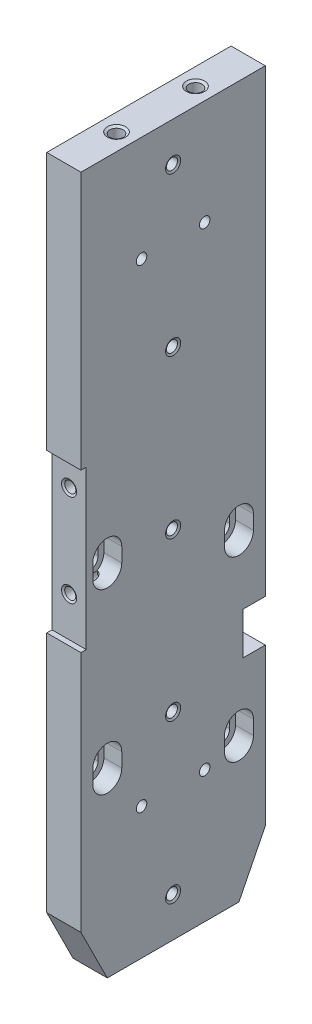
ISO-10303-21;
HEADER;
FILE_DESCRIPTION(('STEP AP214'),'2;1');
FILE_NAME('part.step','',(''),(''),'','','');
FILE_SCHEMA(('AUTOMOTIVE_DESIGN { 1 0 10303 214 1 1 1 1 }'));
ENDSEC;
DATA;
#1=APPLICATION_CONTEXT('core data for automotive mechanical design processes');
#2=APPLICATION_PROTOCOL_DEFINITION('international standard','automotive_design',2000,#1);
#3=PRODUCT_CONTEXT('',#1,'mechanical');
#4=PRODUCT('Part','Part','',(#3));
#5=PRODUCT_RELATED_PRODUCT_CATEGORY('part','',(#4));
#6=PRODUCT_DEFINITION_FORMATION('','',#4);
#7=PRODUCT_DEFINITION_CONTEXT('part definition',#1,'design');
#8=PRODUCT_DEFINITION('design','',#6,#7);
#9=PRODUCT_DEFINITION_SHAPE('','',#8);
#10=(LENGTH_UNIT() NAMED_UNIT(*) SI_UNIT(.MILLI.,.METRE.));
#11=(NAMED_UNIT(*) PLANE_ANGLE_UNIT() SI_UNIT($,.RADIAN.));
#12=(NAMED_UNIT(*) SI_UNIT($,.STERADIAN.) SOLID_ANGLE_UNIT());
#13=UNCERTAINTY_MEASURE_WITH_UNIT(LENGTH_MEASURE(1.E-05),#10,'distance_accuracy_value','');
#14=(GEOMETRIC_REPRESENTATION_CONTEXT(3) GLOBAL_UNCERTAINTY_ASSIGNED_CONTEXT((#13)) GLOBAL_UNIT_ASSIGNED_CONTEXT((#10,
#11,#12)) REPRESENTATION_CONTEXT('',''));
#15=CARTESIAN_POINT('',(0.,0.,0.));
#16=DIRECTION('',(0.,0.,1.));
#17=DIRECTION('',(1.,0.,0.));
#18=AXIS2_PLACEMENT_3D('',#15,#16,#17);
#19=CARTESIAN_POINT('',(15.,0.,0.));
#20=DIRECTION('',(-1.,0.,0.));
#21=DIRECTION('',(0.,0.,1.));
#22=AXIS2_PLACEMENT_3D('',#19,#20,#21);
#23=PLANE('',#22);
#24=DIRECTION('',(0.,1.,0.));
#25=VECTOR('',#24,1.);
#26=CARTESIAN_POINT('',(15.,28.8,30.5));
#27=LINE('',#26,#25);
#28=CARTESIAN_POINT('',(15.,28.8,30.5));
#29=VERTEX_POINT('',#28);
#30=CARTESIAN_POINT('',(15.,34.2,30.5));
#31=VERTEX_POINT('',#30);
#32=EDGE_CURVE('E330',#29,#31,#27,.T.);
#33=ORIENTED_EDGE('',*,*,#32,.T.);
#34=CARTESIAN_POINT('',(15.,34.2,25.));
#35=DIRECTION('',(1.,0.,0.));
#36=DIRECTION('',(0.,0.,-1.));
#37=AXIS2_PLACEMENT_3D('',#34,#35,#36);
#38=CIRCLE('',#37,5.5);
#39=CARTESIAN_POINT('',(15.,34.2,19.5));
#40=VERTEX_POINT('',#39);
#41=EDGE_CURVE('E368',#40,#31,#38,.T.);
#42=ORIENTED_EDGE('',*,*,#41,.F.);
#43=DIRECTION('',(0.,1.,0.));
#44=VECTOR('',#43,1.);
#45=CARTESIAN_POINT('',(15.,28.8,19.5));
#46=LINE('',#45,#44);
#47=CARTESIAN_POINT('',(15.,28.8,19.5));
#48=VERTEX_POINT('',#47);
#49=EDGE_CURVE('E350',#48,#40,#46,.T.);
#50=ORIENTED_EDGE('',*,*,#49,.F.);
#51=CARTESIAN_POINT('',(15.,28.8,25.));
#52=DIRECTION('',(1.,0.,0.));
#53=DIRECTION('',(0.,0.,-1.));
#54=AXIS2_PLACEMENT_3D('',#51,#52,#53);
#55=CIRCLE('',#54,5.5);
#56=EDGE_CURVE('E37',#29,#48,#55,.T.);
#57=ORIENTED_EDGE('',*,*,#56,.F.);
#58=EDGE_LOOP('',(#33,#42,#50,#57));
#59=FACE_BOUND('',#58,.T.);
#60=CARTESIAN_POINT('',(15.,14.5,-25.));
#61=DIRECTION('',(1.,0.,0.));
#62=DIRECTION('',(0.,0.,-1.));
#63=AXIS2_PLACEMENT_3D('',#60,#61,#62);
#64=CIRCLE('',#63,5.5);
#65=CARTESIAN_POINT('',(15.,14.5,-19.5));
#66=VERTEX_POINT('',#65);
#67=CARTESIAN_POINT('',(15.,14.5,-30.5));
#68=VERTEX_POINT('',#67);
#69=EDGE_CURVE('E408',#66,#68,#64,.T.);
#70=ORIENTED_EDGE('',*,*,#69,.F.);
#71=DIRECTION('',(0.,1.,0.));
#72=VECTOR('',#71,1.);
#73=CARTESIAN_POINT('',(15.,14.5,-19.5));
#74=LINE('',#73,#72);
#75=CARTESIAN_POINT('',(15.,19.9,-19.5));
#76=VERTEX_POINT('',#75);
#77=EDGE_CURVE('E400',#66,#76,#74,.T.);
#78=ORIENTED_EDGE('',*,*,#77,.T.);
#79=CARTESIAN_POINT('',(15.,19.9,-25.));
#80=DIRECTION('',(1.,0.,0.));
#81=DIRECTION('',(0.,0.,-1.));
#82=AXIS2_PLACEMENT_3D('',#79,#80,#81);
#83=CIRCLE('',#82,5.5);
#84=CARTESIAN_POINT('',(15.,19.9,-30.5));
#85=VERTEX_POINT('',#84);
#86=EDGE_CURVE('E430',#85,#76,#83,.T.);
#87=ORIENTED_EDGE('',*,*,#86,.F.);
#88=DIRECTION('',(0.,1.,0.));
#89=VECTOR('',#88,1.);
#90=CARTESIAN_POINT('',(15.,14.5,-30.5));
#91=LINE('',#90,#89);
#92=EDGE_CURVE('E383',#68,#85,#91,.T.);
#93=ORIENTED_EDGE('',*,*,#92,.F.);
#94=EDGE_LOOP('',(#70,#78,#87,#93));
#95=FACE_BOUND('',#94,.T.);
#96=DIRECTION('',(0.,1.,0.));
#97=VECTOR('',#96,1.);
#98=CARTESIAN_POINT('',(15.,-38.7,30.5));
#99=LINE('',#98,#97);
#100=CARTESIAN_POINT('',(15.,-38.7,30.5));
#101=VERTEX_POINT('',#100);
#102=CARTESIAN_POINT('',(15.,-33.3,30.5));
#103=VERTEX_POINT('',#102);
#104=EDGE_CURVE('E464',#101,#103,#99,.T.);
#105=ORIENTED_EDGE('',*,*,#104,.T.);
#106=CARTESIAN_POINT('',(15.,-33.3,25.));
#107=DIRECTION('',(1.,0.,0.));
#108=DIRECTION('',(0.,0.,-1.));
#109=AXIS2_PLACEMENT_3D('',#106,#107,#108);
#110=CIRCLE('',#109,5.5);
#111=CARTESIAN_POINT('',(15.,-33.3,19.5));
#112=VERTEX_POINT('',#111);
#113=EDGE_CURVE('E494',#112,#103,#110,.T.);
#114=ORIENTED_EDGE('',*,*,#113,.F.);
#115=DIRECTION('',(0.,1.,0.));
#116=VECTOR('',#115,1.);
#117=CARTESIAN_POINT('',(15.,-38.7,19.5));
#118=LINE('',#117,#116);
#119=CARTESIAN_POINT('',(15.,-38.7,19.5));
#120=VERTEX_POINT('',#119);
#121=EDGE_CURVE('E447',#120,#112,#118,.T.);
#122=ORIENTED_EDGE('',*,*,#121,.F.);
#123=CARTESIAN_POINT('',(15.,-38.7,25.));
#124=DIRECTION('',(1.,0.,0.));
#125=DIRECTION('',(0.,0.,-1.));
#126=AXIS2_PLACEMENT_3D('',#123,#124,#125);
#127=CIRCLE('',#126,5.5);
#128=EDGE_CURVE('E472',#101,#120,#127,.T.);
#129=ORIENTED_EDGE('',*,*,#128,.F.);
#130=EDGE_LOOP('',(#105,#114,#122,#129));
#131=FACE_BOUND('',#130,.T.);
#132=CARTESIAN_POINT('',(15.0000000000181,-90.,-1.21680443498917E-13));
#133=DIRECTION('',(1.,0.,0.));
#134=DIRECTION('',(0.,0.,-1.));
#135=AXIS2_PLACEMENT_3D('',#132,#133,#134);
#136=CIRCLE('',#135,2.85999999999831);
#137=CARTESIAN_POINT('',(15.0000000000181,-90.,-2.85999999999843));
#138=VERTEX_POINT('',#137);
#139=EDGE_CURVE('E699',#138,#138,#136,.T.);
#140=ORIENTED_EDGE('',*,*,#139,.F.);
#141=EDGE_LOOP('',(#140));
#142=FACE_BOUND('',#141,.T.);
#143=CARTESIAN_POINT('',(14.999999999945,-29.9999999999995,0.));
#144=DIRECTION('',(1.,0.,0.));
#145=DIRECTION('',(0.,0.,-1.));
#146=AXIS2_PLACEMENT_3D('',#143,#144,#145);
#147=CIRCLE('',#146,2.86000000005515);
#148=CARTESIAN_POINT('',(14.999999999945,-29.9999999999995,-2.86000000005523));
#149=VERTEX_POINT('',#148);
#150=EDGE_CURVE('E779',#149,#149,#147,.T.);
#151=ORIENTED_EDGE('',*,*,#150,.F.);
#152=EDGE_LOOP('',(#151));
#153=FACE_BOUND('',#152,.T.);
#154=CARTESIAN_POINT('',(14.9999999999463,30.0000000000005,0.));
#155=DIRECTION('',(1.,0.,0.));
#156=DIRECTION('',(0.,0.,-1.));
#157=AXIS2_PLACEMENT_3D('',#154,#155,#156);
#158=CIRCLE('',#157,2.85999999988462);
#159=CARTESIAN_POINT('',(14.9999999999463,30.0000000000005,-2.85999999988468));
#160=VERTEX_POINT('',#159);
#161=EDGE_CURVE('E776',#160,#160,#158,.T.);
#162=ORIENTED_EDGE('',*,*,#161,.F.);
#163=EDGE_LOOP('',(#162));
#164=FACE_BOUND('',#163,.T.);
#165=CARTESIAN_POINT('',(14.9999999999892,90.,0.));
#166=DIRECTION('',(1.,0.,0.));
#167=DIRECTION('',(0.,0.,-1.));
#168=AXIS2_PLACEMENT_3D('',#165,#166,#167);
#169=CIRCLE('',#168,2.85999999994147);
#170=CARTESIAN_POINT('',(14.9999999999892,90.,-2.85999999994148));
#171=VERTEX_POINT('',#170);
#172=EDGE_CURVE('E773',#171,#171,#169,.T.);
#173=ORIENTED_EDGE('',*,*,#172,.F.);
#174=EDGE_LOOP('',(#173));
#175=FACE_BOUND('',#174,.T.);
#176=CARTESIAN_POINT('',(14.9999999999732,150.,0.));
#177=DIRECTION('',(1.,0.,0.));
#178=DIRECTION('',(0.,0.,-1.));
#179=AXIS2_PLACEMENT_3D('',#176,#177,#178);
#180=CIRCLE('',#179,2.85999999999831);
#181=CARTESIAN_POINT('',(14.9999999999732,150.,-2.8599999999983));
#182=VERTEX_POINT('',#181);
#183=EDGE_CURVE('E695',#182,#182,#180,.T.);
#184=ORIENTED_EDGE('',*,*,#183,.F.);
#185=EDGE_LOOP('',(#184));
#186=FACE_BOUND('',#185,.T.);
#187=CARTESIAN_POINT('',(15.,125.,12.));
#188=DIRECTION('',(1.,0.,0.));
#189=DIRECTION('',(0.,0.,-1.));
#190=AXIS2_PLACEMENT_3D('',#187,#188,#189);
#191=CIRCLE('',#190,2.);
#192=CARTESIAN_POINT('',(15.,125.,10.));
#193=VERTEX_POINT('',#192);
#194=EDGE_CURVE('E682',#193,#193,#191,.F.);
#195=ORIENTED_EDGE('',*,*,#194,.T.);
#196=EDGE_LOOP('',(#195));
#197=FACE_BOUND('',#196,.T.);
#198=CARTESIAN_POINT('',(15.,125.,-12.));
#199=DIRECTION('',(1.,0.,0.));
#200=DIRECTION('',(0.,0.,-1.));
#201=AXIS2_PLACEMENT_3D('',#198,#199,#200);
#202=CIRCLE('',#201,2.);
#203=CARTESIAN_POINT('',(15.,125.,-14.));
#204=VERTEX_POINT('',#203);
#205=EDGE_CURVE('E766',#204,#204,#202,.F.);
#206=ORIENTED_EDGE('',*,*,#205,.T.);
#207=EDGE_LOOP('',(#206));
#208=FACE_BOUND('',#207,.T.);
#209=CARTESIAN_POINT('',(15.,-55.,12.));
#210=DIRECTION('',(1.,0.,0.));
#211=DIRECTION('',(0.,0.,-1.));
#212=AXIS2_PLACEMENT_3D('',#209,#210,#211);
#213=CIRCLE('',#212,2.);
#214=CARTESIAN_POINT('',(15.,-55.,10.));
#215=VERTEX_POINT('',#214);
#216=EDGE_CURVE('E763',#215,#215,#213,.F.);
#217=ORIENTED_EDGE('',*,*,#216,.T.);
#218=EDGE_LOOP('',(#217));
#219=FACE_BOUND('',#218,.T.);
#220=CARTESIAN_POINT('',(15.,-55.,-12.));
#221=DIRECTION('',(1.,0.,0.));
#222=DIRECTION('',(0.,0.,-1.));
#223=AXIS2_PLACEMENT_3D('',#220,#221,#222);
#224=CIRCLE('',#223,2.);
#225=CARTESIAN_POINT('',(15.,-55.,-14.));
#226=VERTEX_POINT('',#225);
#227=EDGE_CURVE('E678',#226,#226,#224,.F.);
#228=ORIENTED_EDGE('',*,*,#227,.T.);
#229=EDGE_LOOP('',(#228));
#230=FACE_BOUND('',#229,.T.);
#231=DIRECTION('',(0.,1.,0.));
#232=VECTOR('',#231,1.);
#233=CARTESIAN_POINT('',(15.,130.,35.));
#234=LINE('',#233,#232);
#235=CARTESIAN_POINT('',(15.,6.9999999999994,35.));
#236=VERTEX_POINT('',#235);
#237=CARTESIAN_POINT('',(15.,-85.,35.));
#238=VERTEX_POINT('',#237);
#239=EDGE_CURVE('E675',#236,#238,#234,.F.);
#240=ORIENTED_EDGE('',*,*,#239,.T.);
#241=DIRECTION('',(0.,0.894427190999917,0.447213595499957));
#242=VECTOR('',#241,1.);
#243=CARTESIAN_POINT('',(15.,-105.,25.));
#244=LINE('',#243,#242);
#245=CARTESIAN_POINT('',(15.000000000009,-105.,25.));
#246=VERTEX_POINT('',#245);
#247=EDGE_CURVE('E801',#238,#246,#244,.F.);
#248=ORIENTED_EDGE('',*,*,#247,.T.);
#249=DIRECTION('',(0.,0.,-1.));
#250=VECTOR('',#249,1.);
#251=CARTESIAN_POINT('',(15.0000000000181,-105.,-35.));
#252=LINE('',#251,#250);
#253=CARTESIAN_POINT('',(15.000000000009,-105.,-25.));
#254=VERTEX_POINT('',#253);
#255=EDGE_CURVE('E578',#246,#254,#252,.T.);
#256=ORIENTED_EDGE('',*,*,#255,.T.);
#257=DIRECTION('',(0.,-0.894427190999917,0.447213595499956));
#258=VECTOR('',#257,1.);
#259=CARTESIAN_POINT('',(15.,-85.,-35.));
#260=LINE('',#259,#258);
#261=CARTESIAN_POINT('',(15.,-85.,-35.));
#262=VERTEX_POINT('',#261);
#263=EDGE_CURVE('E792',#254,#262,#260,.F.);
#264=ORIENTED_EDGE('',*,*,#263,.T.);
#265=DIRECTION('',(0.,-1.,0.));
#266=VECTOR('',#265,1.);
#267=CARTESIAN_POINT('',(15.,130.,-35.));
#268=LINE('',#267,#266);
#269=CARTESIAN_POINT('',(15.,-25.5,-35.));
#270=VERTEX_POINT('',#269);
#271=EDGE_CURVE('E619',#262,#270,#268,.F.);
#272=ORIENTED_EDGE('',*,*,#271,.T.);
#273=DIRECTION('',(0.,0.,1.));
#274=VECTOR('',#273,1.);
#275=CARTESIAN_POINT('',(15.,-25.5,-24.));
#276=LINE('',#275,#274);
#277=CARTESIAN_POINT('',(15.,-25.5,-26.5));
#278=VERTEX_POINT('',#277);
#279=EDGE_CURVE('E624',#278,#270,#276,.F.);
#280=ORIENTED_EDGE('',*,*,#279,.F.);
#281=DIRECTION('',(0.,1.,0.));
#282=VECTOR('',#281,1.);
#283=CARTESIAN_POINT('',(15.,-39.5000000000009,-26.5));
#284=LINE('',#283,#282);
#285=CARTESIAN_POINT('',(15.,-9.5000000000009,-26.5));
#286=VERTEX_POINT('',#285);
#287=EDGE_CURVE('E630',#286,#278,#284,.F.);
#288=ORIENTED_EDGE('',*,*,#287,.F.);
#289=DIRECTION('',(0.,0.,-1.));
#290=VECTOR('',#289,1.);
#291=CARTESIAN_POINT('',(15.,-9.50000000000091,-24.));
#292=LINE('',#291,#290);
#293=CARTESIAN_POINT('',(15.,-9.5000000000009,-35.));
#294=VERTEX_POINT('',#293);
#295=EDGE_CURVE('E634',#294,#286,#292,.F.);
#296=ORIENTED_EDGE('',*,*,#295,.F.);
#297=DIRECTION('',(0.,-1.,0.));
#298=VECTOR('',#297,1.);
#299=CARTESIAN_POINT('',(15.,130.,-35.));
#300=LINE('',#299,#298);
#301=CARTESIAN_POINT('',(15.,165.,-35.));
#302=VERTEX_POINT('',#301);
#303=EDGE_CURVE('E640',#294,#302,#300,.F.);
#304=ORIENTED_EDGE('',*,*,#303,.T.);
#305=DIRECTION('',(0.,0.,-1.));
#306=VECTOR('',#305,1.);
#307=CARTESIAN_POINT('',(15.,165.,-36.));
#308=LINE('',#307,#306);
#309=CARTESIAN_POINT('',(15.,165.,35.));
#310=VERTEX_POINT('',#309);
#311=EDGE_CURVE('E645',#302,#310,#308,.F.);
#312=ORIENTED_EDGE('',*,*,#311,.T.);
#313=DIRECTION('',(0.,1.,0.));
#314=VECTOR('',#313,1.);
#315=CARTESIAN_POINT('',(15.,130.,35.));
#316=LINE('',#315,#314);
#317=CARTESIAN_POINT('',(15.,66.9999999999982,35.));
#318=VERTEX_POINT('',#317);
#319=EDGE_CURVE('E654',#310,#318,#316,.F.);
#320=ORIENTED_EDGE('',*,*,#319,.T.);
#321=DIRECTION('',(0.,0.,-1.));
#322=VECTOR('',#321,1.);
#323=CARTESIAN_POINT('',(15.,66.9999999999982,35.));
#324=LINE('',#323,#322);
#325=CARTESIAN_POINT('',(15.,66.9999999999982,33.));
#326=VERTEX_POINT('',#325);
#327=EDGE_CURVE('E656',#326,#318,#324,.F.);
#328=ORIENTED_EDGE('',*,*,#327,.F.);
#329=DIRECTION('',(0.,1.,0.));
#330=VECTOR('',#329,1.);
#331=CARTESIAN_POINT('',(15.,0.999999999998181,33.));
#332=LINE('',#331,#330);
#333=CARTESIAN_POINT('',(15.,6.9999999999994,33.));
#334=VERTEX_POINT('',#333);
#335=EDGE_CURVE('E665',#334,#326,#332,.T.);
#336=ORIENTED_EDGE('',*,*,#335,.F.);
#337=DIRECTION('',(0.,0.,1.));
#338=VECTOR('',#337,1.);
#339=CARTESIAN_POINT('',(15.,6.9999999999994,35.));
#340=LINE('',#339,#338);
#341=EDGE_CURVE('E668',#236,#334,#340,.F.);
#342=ORIENTED_EDGE('',*,*,#341,.F.);
#343=EDGE_LOOP('',(#240,#248,#256,#264,#272,#280,#288,#296,#304,#312,#320,#328,#336,#342));
#344=FACE_BOUND('',#343,.T.);
#345=CARTESIAN_POINT('',(15.,-47.6,-25.));
#346=DIRECTION('',(1.,0.,0.));
#347=DIRECTION('',(0.,0.,-1.));
#348=AXIS2_PLACEMENT_3D('',#345,#346,#347);
#349=CIRCLE('',#348,5.5);
#350=CARTESIAN_POINT('',(15.,-47.6,-30.5));
#351=VERTEX_POINT('',#350);
#352=CARTESIAN_POINT('',(15.,-47.6,-19.5));
#353=VERTEX_POINT('',#352);
#354=EDGE_CURVE('E560',#351,#353,#349,.T.);
#355=ORIENTED_EDGE('',*,*,#354,.F.);
#356=DIRECTION('',(0.,1.,0.));
#357=VECTOR('',#356,1.);
#358=CARTESIAN_POINT('',(15.,-53.,-30.5));
#359=LINE('',#358,#357);
#360=CARTESIAN_POINT('',(15.,-53.,-30.5));
#361=VERTEX_POINT('',#360);
#362=EDGE_CURVE('E511',#361,#351,#359,.T.);
#363=ORIENTED_EDGE('',*,*,#362,.F.);
#364=CARTESIAN_POINT('',(15.,-53.,-25.));
#365=DIRECTION('',(1.,0.,0.));
#366=DIRECTION('',(0.,0.,-1.));
#367=AXIS2_PLACEMENT_3D('',#364,#365,#366);
#368=CIRCLE('',#367,5.5);
#369=CARTESIAN_POINT('',(15.,-53.,-19.5));
#370=VERTEX_POINT('',#369);
#371=EDGE_CURVE('E537',#370,#361,#368,.T.);
#372=ORIENTED_EDGE('',*,*,#371,.F.);
#373=DIRECTION('',(0.,1.,0.));
#374=VECTOR('',#373,1.);
#375=CARTESIAN_POINT('',(15.,-53.,-19.5));
#376=LINE('',#375,#374);
#377=EDGE_CURVE('E528',#370,#353,#376,.T.);
#378=ORIENTED_EDGE('',*,*,#377,.T.);
#379=EDGE_LOOP('',(#355,#363,#372,#378));
#380=FACE_BOUND('',#379,.T.);
#381=ADVANCED_FACE('F16',(#59,#95,#131,#142,#153,#164,#175,#186,#197,#208,#219,#230,#344,#380),
#23,.F.);
#382=CARTESIAN_POINT('',(2.,0.,0.));
#383=DIRECTION('',(-1.,0.,0.));
#384=DIRECTION('',(0.,0.,1.));
#385=AXIS2_PLACEMENT_3D('',#382,#383,#384);
#386=PLANE('',#385);
#387=CARTESIAN_POINT('',(2.,28.8,25.));
#388=DIRECTION('',(1.,0.,0.));
#389=DIRECTION('',(0.,0.,-1.));
#390=AXIS2_PLACEMENT_3D('',#387,#388,#389);
#391=CIRCLE('',#390,3.3);
#392=CARTESIAN_POINT('',(2.,28.8,28.3));
#393=VERTEX_POINT('',#392);
#394=CARTESIAN_POINT('',(2.,28.8,21.7));
#395=VERTEX_POINT('',#394);
#396=EDGE_CURVE('E360',#393,#395,#391,.T.);
#397=ORIENTED_EDGE('',*,*,#396,.T.);
#398=DIRECTION('',(0.,1.,0.));
#399=VECTOR('',#398,1.);
#400=CARTESIAN_POINT('',(2.,28.8,21.7));
#401=LINE('',#400,#399);
#402=CARTESIAN_POINT('',(2.,34.2,21.7));
#403=VERTEX_POINT('',#402);
#404=EDGE_CURVE('E1779',#395,#403,#401,.T.);
#405=ORIENTED_EDGE('',*,*,#404,.T.);
#406=CARTESIAN_POINT('',(2.,34.2,25.));
#407=DIRECTION('',(1.,0.,0.));
#408=DIRECTION('',(0.,0.,-1.));
#409=AXIS2_PLACEMENT_3D('',#406,#407,#408);
#410=CIRCLE('',#409,3.3);
#411=CARTESIAN_POINT('',(2.,34.2,28.3));
#412=VERTEX_POINT('',#411);
#413=EDGE_CURVE('E376',#403,#412,#410,.T.);
#414=ORIENTED_EDGE('',*,*,#413,.T.);
#415=DIRECTION('',(0.,1.,0.));
#416=VECTOR('',#415,1.);
#417=CARTESIAN_POINT('',(2.,28.8,28.3));
#418=LINE('',#417,#416);
#419=EDGE_CURVE('E1785',#393,#412,#418,.T.);
#420=ORIENTED_EDGE('',*,*,#419,.F.);
#421=EDGE_LOOP('',(#397,#405,#414,#420));
#422=FACE_BOUND('',#421,.T.);
#423=DIRECTION('',(0.,1.,0.));
#424=VECTOR('',#423,1.);
#425=CARTESIAN_POINT('',(2.,14.5,-21.7));
#426=LINE('',#425,#424);
#427=CARTESIAN_POINT('',(2.,14.5,-21.7));
#428=VERTEX_POINT('',#427);
#429=CARTESIAN_POINT('',(2.,19.9,-21.7));
#430=VERTEX_POINT('',#429);
#431=EDGE_CURVE('E394',#428,#430,#426,.T.);
#432=ORIENTED_EDGE('',*,*,#431,.F.);
#433=CARTESIAN_POINT('',(2.,14.5,-25.));
#434=DIRECTION('',(1.,0.,0.));
#435=DIRECTION('',(0.,0.,-1.));
#436=AXIS2_PLACEMENT_3D('',#433,#434,#435);
#437=CIRCLE('',#436,3.3);
#438=CARTESIAN_POINT('',(2.,14.5,-28.3));
#439=VERTEX_POINT('',#438);
#440=EDGE_CURVE('E416',#428,#439,#437,.T.);
#441=ORIENTED_EDGE('',*,*,#440,.T.);
#442=DIRECTION('',(0.,1.,0.));
#443=VECTOR('',#442,1.);
#444=CARTESIAN_POINT('',(2.,14.5,-28.3));
#445=LINE('',#444,#443);
#446=CARTESIAN_POINT('',(2.,19.9,-28.3));
#447=VERTEX_POINT('',#446);
#448=EDGE_CURVE('E391',#439,#447,#445,.T.);
#449=ORIENTED_EDGE('',*,*,#448,.T.);
#450=CARTESIAN_POINT('',(2.,19.9,-25.));
#451=DIRECTION('',(1.,0.,0.));
#452=DIRECTION('',(0.,0.,-1.));
#453=AXIS2_PLACEMENT_3D('',#450,#451,#452);
#454=CIRCLE('',#453,3.3);
#455=EDGE_CURVE('E439',#447,#430,#454,.T.);
#456=ORIENTED_EDGE('',*,*,#455,.T.);
#457=EDGE_LOOP('',(#432,#441,#449,#456));
#458=FACE_BOUND('',#457,.T.);
#459=CARTESIAN_POINT('',(2.,-38.7,25.));
#460=DIRECTION('',(1.,0.,0.));
#461=DIRECTION('',(0.,0.,-1.));
#462=AXIS2_PLACEMENT_3D('',#459,#460,#461);
#463=CIRCLE('',#462,3.3);
#464=CARTESIAN_POINT('',(2.,-38.7,28.3));
#465=VERTEX_POINT('',#464);
#466=CARTESIAN_POINT('',(2.,-38.7,21.7));
#467=VERTEX_POINT('',#466);
#468=EDGE_CURVE('E480',#465,#467,#463,.T.);
#469=ORIENTED_EDGE('',*,*,#468,.T.);
#470=DIRECTION('',(0.,1.,0.));
#471=VECTOR('',#470,1.);
#472=CARTESIAN_POINT('',(2.,-38.7,21.7));
#473=LINE('',#472,#471);
#474=CARTESIAN_POINT('',(2.,-33.3,21.7));
#475=VERTEX_POINT('',#474);
#476=EDGE_CURVE('E455',#467,#475,#473,.T.);
#477=ORIENTED_EDGE('',*,*,#476,.T.);
#478=CARTESIAN_POINT('',(2.,-33.3,25.));
#479=DIRECTION('',(1.,0.,0.));
#480=DIRECTION('',(0.,0.,-1.));
#481=AXIS2_PLACEMENT_3D('',#478,#479,#480);
#482=CIRCLE('',#481,3.3);
#483=CARTESIAN_POINT('',(2.,-33.3,28.3));
#484=VERTEX_POINT('',#483);
#485=EDGE_CURVE('E503',#475,#484,#482,.T.);
#486=ORIENTED_EDGE('',*,*,#485,.T.);
#487=DIRECTION('',(0.,1.,0.));
#488=VECTOR('',#487,1.);
#489=CARTESIAN_POINT('',(2.,-38.7,28.3));
#490=LINE('',#489,#488);
#491=EDGE_CURVE('E458',#465,#484,#490,.T.);
#492=ORIENTED_EDGE('',*,*,#491,.F.);
#493=EDGE_LOOP('',(#469,#477,#486,#492));
#494=FACE_BOUND('',#493,.T.);
#495=DIRECTION('',(0.,0.,-1.));
#496=VECTOR('',#495,1.);
#497=CARTESIAN_POINT('',(2.,-105.,-35.));
#498=LINE('',#497,#496);
#499=CARTESIAN_POINT('',(2.,-105.,25.));
#500=VERTEX_POINT('',#499);
#501=CARTESIAN_POINT('',(2.,-105.,-25.));
#502=VERTEX_POINT('',#501);
#503=EDGE_CURVE('E577',#500,#502,#498,.T.);
#504=ORIENTED_EDGE('',*,*,#503,.F.);
#505=DIRECTION('',(0.,-0.894427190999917,-0.447213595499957));
#506=VECTOR('',#505,1.);
#507=CARTESIAN_POINT('',(2.,-31.,62.));
#508=LINE('',#507,#506);
#509=CARTESIAN_POINT('',(2.,-85.,35.));
#510=VERTEX_POINT('',#509);
#511=EDGE_CURVE('E797',#500,#510,#508,.F.);
#512=ORIENTED_EDGE('',*,*,#511,.T.);
#513=DIRECTION('',(0.,1.,0.));
#514=VECTOR('',#513,1.);
#515=CARTESIAN_POINT('',(2.,0.,35.));
#516=LINE('',#515,#514);
#517=CARTESIAN_POINT('',(2.,6.9999999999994,35.));
#518=VERTEX_POINT('',#517);
#519=EDGE_CURVE('E613',#510,#518,#516,.T.);
#520=ORIENTED_EDGE('',*,*,#519,.T.);
#521=DIRECTION('',(0.,0.,1.));
#522=VECTOR('',#521,1.);
#523=CARTESIAN_POINT('',(2.,6.9999999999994,0.));
#524=LINE('',#523,#522);
#525=CARTESIAN_POINT('',(2.,6.9999999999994,33.));
#526=VERTEX_POINT('',#525);
#527=EDGE_CURVE('E610',#518,#526,#524,.F.);
#528=ORIENTED_EDGE('',*,*,#527,.T.);
#529=DIRECTION('',(0.,1.,0.));
#530=VECTOR('',#529,1.);
#531=CARTESIAN_POINT('',(2.,0.,33.));
#532=LINE('',#531,#530);
#533=CARTESIAN_POINT('',(2.,66.9999999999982,33.));
#534=VERTEX_POINT('',#533);
#535=EDGE_CURVE('E607',#526,#534,#532,.T.);
#536=ORIENTED_EDGE('',*,*,#535,.T.);
#537=DIRECTION('',(0.,0.,1.));
#538=VECTOR('',#537,1.);
#539=CARTESIAN_POINT('',(2.,66.9999999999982,0.));
#540=LINE('',#539,#538);
#541=CARTESIAN_POINT('',(2.,66.9999999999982,35.));
#542=VERTEX_POINT('',#541);
#543=EDGE_CURVE('E604',#534,#542,#540,.T.);
#544=ORIENTED_EDGE('',*,*,#543,.T.);
#545=DIRECTION('',(0.,1.,0.));
#546=VECTOR('',#545,1.);
#547=CARTESIAN_POINT('',(2.,0.,35.));
#548=LINE('',#547,#546);
#549=CARTESIAN_POINT('',(2.,165.,35.));
#550=VERTEX_POINT('',#549);
#551=EDGE_CURVE('E601',#542,#550,#548,.T.);
#552=ORIENTED_EDGE('',*,*,#551,.T.);
#553=DIRECTION('',(0.,0.,1.));
#554=VECTOR('',#553,1.);
#555=CARTESIAN_POINT('',(2.,165.,0.));
#556=LINE('',#555,#554);
#557=CARTESIAN_POINT('',(2.,165.,-35.));
#558=VERTEX_POINT('',#557);
#559=EDGE_CURVE('E598',#550,#558,#556,.F.);
#560=ORIENTED_EDGE('',*,*,#559,.T.);
#561=DIRECTION('',(0.,1.,0.));
#562=VECTOR('',#561,1.);
#563=CARTESIAN_POINT('',(2.,0.,-35.));
#564=LINE('',#563,#562);
#565=CARTESIAN_POINT('',(2.,-9.50000000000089,-35.));
#566=VERTEX_POINT('',#565);
#567=EDGE_CURVE('E595',#558,#566,#564,.F.);
#568=ORIENTED_EDGE('',*,*,#567,.T.);
#569=DIRECTION('',(0.,0.,1.));
#570=VECTOR('',#569,1.);
#571=CARTESIAN_POINT('',(2.,-9.50000000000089,0.));
#572=LINE('',#571,#570);
#573=CARTESIAN_POINT('',(2.,-9.5000000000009,-26.5));
#574=VERTEX_POINT('',#573);
#575=EDGE_CURVE('E592',#566,#574,#572,.T.);
#576=ORIENTED_EDGE('',*,*,#575,.T.);
#577=DIRECTION('',(0.,1.,0.));
#578=VECTOR('',#577,1.);
#579=CARTESIAN_POINT('',(2.,0.,-26.5));
#580=LINE('',#579,#578);
#581=CARTESIAN_POINT('',(2.,-25.5,-26.5));
#582=VERTEX_POINT('',#581);
#583=EDGE_CURVE('E589',#574,#582,#580,.F.);
#584=ORIENTED_EDGE('',*,*,#583,.T.);
#585=DIRECTION('',(0.,0.,1.));
#586=VECTOR('',#585,1.);
#587=CARTESIAN_POINT('',(2.,-25.5,0.));
#588=LINE('',#587,#586);
#589=CARTESIAN_POINT('',(2.,-25.5,-35.));
#590=VERTEX_POINT('',#589);
#591=EDGE_CURVE('E586',#582,#590,#588,.F.);
#592=ORIENTED_EDGE('',*,*,#591,.T.);
#593=DIRECTION('',(0.,1.,0.));
#594=VECTOR('',#593,1.);
#595=CARTESIAN_POINT('',(2.,0.,-35.));
#596=LINE('',#595,#594);
#597=CARTESIAN_POINT('',(2.,-85.,-35.));
#598=VERTEX_POINT('',#597);
#599=EDGE_CURVE('E582',#590,#598,#596,.F.);
#600=ORIENTED_EDGE('',*,*,#599,.T.);
#601=DIRECTION('',(0.,0.894427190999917,-0.447213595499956));
#602=VECTOR('',#601,1.);
#603=CARTESIAN_POINT('',(2.,-31.,-62.));
#604=LINE('',#603,#602);
#605=EDGE_CURVE('E786',#598,#502,#604,.F.);
#606=ORIENTED_EDGE('',*,*,#605,.T.);
#607=EDGE_LOOP('',(#504,#512,#520,#528,#536,#544,#552,#560,#568,#576,#584,#592,#600,#606));
#608=FACE_BOUND('',#607,.T.);
#609=CARTESIAN_POINT('',(2.,-55.,-12.));
#610=DIRECTION('',(1.,0.,0.));
#611=DIRECTION('',(0.,0.,-1.));
#612=AXIS2_PLACEMENT_3D('',#609,#610,#611);
#613=CIRCLE('',#612,2.);
#614=CARTESIAN_POINT('',(2.,-55.,-14.));
#615=VERTEX_POINT('',#614);
#616=EDGE_CURVE('E615',#615,#615,#613,.T.);
#617=ORIENTED_EDGE('',*,*,#616,.T.);
#618=EDGE_LOOP('',(#617));
#619=FACE_BOUND('',#618,.T.);
#620=CARTESIAN_POINT('',(2.,-55.,12.));
#621=DIRECTION('',(1.,0.,0.));
#622=DIRECTION('',(0.,0.,-1.));
#623=AXIS2_PLACEMENT_3D('',#620,#621,#622);
#624=CIRCLE('',#623,2.);
#625=CARTESIAN_POINT('',(2.,-55.,10.));
#626=VERTEX_POINT('',#625);
#627=EDGE_CURVE('E728',#626,#626,#624,.T.);
#628=ORIENTED_EDGE('',*,*,#627,.T.);
#629=EDGE_LOOP('',(#628));
#630=FACE_BOUND('',#629,.T.);
#631=CARTESIAN_POINT('',(2.,125.,-12.));
#632=DIRECTION('',(1.,0.,0.));
#633=DIRECTION('',(0.,0.,-1.));
#634=AXIS2_PLACEMENT_3D('',#631,#632,#633);
#635=CIRCLE('',#634,2.);
#636=CARTESIAN_POINT('',(2.,125.,-14.));
#637=VERTEX_POINT('',#636);
#638=EDGE_CURVE('E731',#637,#637,#635,.T.);
#639=ORIENTED_EDGE('',*,*,#638,.T.);
#640=EDGE_LOOP('',(#639));
#641=FACE_BOUND('',#640,.T.);
#642=CARTESIAN_POINT('',(2.,125.,12.));
#643=DIRECTION('',(1.,0.,0.));
#644=DIRECTION('',(0.,0.,-1.));
#645=AXIS2_PLACEMENT_3D('',#642,#643,#644);
#646=CIRCLE('',#645,2.);
#647=CARTESIAN_POINT('',(2.,125.,10.));
#648=VERTEX_POINT('',#647);
#649=EDGE_CURVE('E734',#648,#648,#646,.T.);
#650=ORIENTED_EDGE('',*,*,#649,.T.);
#651=EDGE_LOOP('',(#650));
#652=FACE_BOUND('',#651,.T.);
#653=CARTESIAN_POINT('',(2.,150.,0.));
#654=DIRECTION('',(1.,0.,0.));
#655=DIRECTION('',(0.,0.,-1.));
#656=AXIS2_PLACEMENT_3D('',#653,#654,#655);
#657=CIRCLE('',#656,2.1);
#658=CARTESIAN_POINT('',(2.,150.,-2.09999999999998));
#659=VERTEX_POINT('',#658);
#660=EDGE_CURVE('E737',#659,#659,#657,.T.);
#661=ORIENTED_EDGE('',*,*,#660,.T.);
#662=EDGE_LOOP('',(#661));
#663=FACE_BOUND('',#662,.T.);
#664=CARTESIAN_POINT('',(2.,90.,0.));
#665=DIRECTION('',(1.,0.,0.));
#666=DIRECTION('',(0.,0.,-1.));
#667=AXIS2_PLACEMENT_3D('',#664,#665,#666);
#668=CIRCLE('',#667,2.1);
#669=CARTESIAN_POINT('',(2.,90.,-2.10000000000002));
#670=VERTEX_POINT('',#669);
#671=EDGE_CURVE('E740',#670,#670,#668,.T.);
#672=ORIENTED_EDGE('',*,*,#671,.T.);
#673=EDGE_LOOP('',(#672));
#674=FACE_BOUND('',#673,.T.);
#675=CARTESIAN_POINT('',(2.,30.0000000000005,0.));
#676=DIRECTION('',(1.,0.,0.));
#677=DIRECTION('',(0.,0.,-1.));
#678=AXIS2_PLACEMENT_3D('',#675,#676,#677);
#679=CIRCLE('',#678,2.1);
#680=CARTESIAN_POINT('',(2.,30.0000000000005,-2.10000000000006));
#681=VERTEX_POINT('',#680);
#682=EDGE_CURVE('E743',#681,#681,#679,.T.);
#683=ORIENTED_EDGE('',*,*,#682,.T.);
#684=EDGE_LOOP('',(#683));
#685=FACE_BOUND('',#684,.T.);
#686=CARTESIAN_POINT('',(2.,-29.9999999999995,0.));
#687=DIRECTION('',(1.,0.,0.));
#688=DIRECTION('',(0.,0.,-1.));
#689=AXIS2_PLACEMENT_3D('',#686,#687,#688);
#690=CIRCLE('',#689,2.1);
#691=CARTESIAN_POINT('',(2.,-29.9999999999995,-2.10000000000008));
#692=VERTEX_POINT('',#691);
#693=EDGE_CURVE('E746',#692,#692,#690,.T.);
#694=ORIENTED_EDGE('',*,*,#693,.T.);
#695=EDGE_LOOP('',(#694));
#696=FACE_BOUND('',#695,.T.);
#697=CARTESIAN_POINT('',(2.,-90.,-1.21680443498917E-13));
#698=DIRECTION('',(1.,0.,0.));
#699=DIRECTION('',(0.,0.,-1.));
#700=AXIS2_PLACEMENT_3D('',#697,#698,#699);
#701=CIRCLE('',#700,2.1);
#702=CARTESIAN_POINT('',(2.,-90.,-2.10000000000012));
#703=VERTEX_POINT('',#702);
#704=EDGE_CURVE('E618',#703,#703,#701,.T.);
#705=ORIENTED_EDGE('',*,*,#704,.T.);
#706=EDGE_LOOP('',(#705));
#707=FACE_BOUND('',#706,.T.);
#708=DIRECTION('',(0.,1.,0.));
#709=VECTOR('',#708,1.);
#710=CARTESIAN_POINT('',(2.,-53.,-28.3));
#711=LINE('',#710,#709);
#712=CARTESIAN_POINT('',(2.,-53.,-28.3));
#713=VERTEX_POINT('',#712);
#714=CARTESIAN_POINT('',(2.,-47.6,-28.3));
#715=VERTEX_POINT('',#714);
#716=EDGE_CURVE('E519',#713,#715,#711,.T.);
#717=ORIENTED_EDGE('',*,*,#716,.T.);
#718=CARTESIAN_POINT('',(2.,-47.6,-25.));
#719=DIRECTION('',(1.,0.,0.));
#720=DIRECTION('',(0.,0.,-1.));
#721=AXIS2_PLACEMENT_3D('',#718,#719,#720);
#722=CIRCLE('',#721,3.3);
#723=CARTESIAN_POINT('',(2.,-47.6,-21.7));
#724=VERTEX_POINT('',#723);
#725=EDGE_CURVE('E569',#715,#724,#722,.T.);
#726=ORIENTED_EDGE('',*,*,#725,.T.);
#727=DIRECTION('',(0.,1.,0.));
#728=VECTOR('',#727,1.);
#729=CARTESIAN_POINT('',(2.,-53.,-21.7));
#730=LINE('',#729,#728);
#731=CARTESIAN_POINT('',(2.,-53.,-21.7));
#732=VERTEX_POINT('',#731);
#733=EDGE_CURVE('E522',#732,#724,#730,.T.);
#734=ORIENTED_EDGE('',*,*,#733,.F.);
#735=CARTESIAN_POINT('',(2.,-53.,-25.));
#736=DIRECTION('',(1.,0.,0.));
#737=DIRECTION('',(0.,0.,-1.));
#738=AXIS2_PLACEMENT_3D('',#735,#736,#737);
#739=CIRCLE('',#738,3.3);
#740=EDGE_CURVE('E546',#732,#713,#739,.T.);
#741=ORIENTED_EDGE('',*,*,#740,.T.);
#742=EDGE_LOOP('',(#717,#726,#734,#741));
#743=FACE_BOUND('',#742,.T.);
#744=ADVANCED_FACE('F949',(#422,#458,#494,#608,#619,#630,#641,#652,#663,#674,#685,#696,#707,
#743),#386,.T.);
#745=CARTESIAN_POINT('',(8.49999999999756,21.9999999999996,20.2000000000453));
#746=DIRECTION('',(0.,0.,1.));
#747=DIRECTION('',(1.,0.,0.));
#748=AXIS2_PLACEMENT_3D('',#745,#746,#747);
#749=CONICAL_SURFACE('',#748,2.09999999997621,1.02974425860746);
#750=CARTESIAN_POINT('',(8.49999999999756,22.0000000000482,18.9381927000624));
#751=VERTEX_POINT('',#750);
#752=VERTEX_LOOP('',#751);
#753=FACE_BOUND('',#752,.T.);
#754=CARTESIAN_POINT('',(8.49999999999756,21.9999999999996,20.2));
#755=DIRECTION('',(0.,0.,1.));
#756=DIRECTION('',(0.,-1.,0.));
#757=AXIS2_PLACEMENT_3D('',#754,#755,#756);
#758=CIRCLE('',#757,2.1);
#759=CARTESIAN_POINT('',(8.49999999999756,19.8999999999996,20.2));
#760=VERTEX_POINT('',#759);
#761=EDGE_CURVE('E580',#760,#760,#758,.T.);
#762=ORIENTED_EDGE('',*,*,#761,.T.);
#763=EDGE_LOOP('',(#762));
#764=FACE_BOUND('',#763,.T.);
#765=ADVANCED_FACE('F948',(#753,#764),#749,.F.);
#766=CARTESIAN_POINT('',(8.49999999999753,56.9999999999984,20.1999999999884));
#767=DIRECTION('',(0.,0.,1.));
#768=DIRECTION('',(1.,0.,0.));
#769=AXIS2_PLACEMENT_3D('',#766,#767,#768);
#770=CONICAL_SURFACE('',#769,2.09999999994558,1.02974425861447);
#771=CARTESIAN_POINT('',(8.49999999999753,56.9999999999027,18.938192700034));
#772=VERTEX_POINT('',#771);
#773=VERTEX_LOOP('',#772);
#774=FACE_BOUND('',#773,.T.);
#775=CARTESIAN_POINT('',(8.49999999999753,56.9999999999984,20.2));
#776=DIRECTION('',(0.,0.,1.));
#777=DIRECTION('',(0.,-1.,0.));
#778=AXIS2_PLACEMENT_3D('',#775,#776,#777);
#779=CIRCLE('',#778,2.1);
#780=CARTESIAN_POINT('',(8.49999999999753,54.8999999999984,20.2));
#781=VERTEX_POINT('',#780);
#782=EDGE_CURVE('E721',#781,#781,#779,.T.);
#783=ORIENTED_EDGE('',*,*,#782,.T.);
#784=EDGE_LOOP('',(#783));
#785=FACE_BOUND('',#784,.T.);
#786=ADVANCED_FACE('F1100',(#774,#785),#770,.F.);
#787=CARTESIAN_POINT('',(8.49999999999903,147.999999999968,15.));
#788=DIRECTION('',(0.,1.,0.));
#789=DIRECTION('',(-1.,0.,0.));
#790=AXIS2_PLACEMENT_3D('',#787,#788,#789);
#791=CONICAL_SURFACE('',#790,2.50000000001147,1.02974425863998);
#792=CARTESIAN_POINT('',(8.49999999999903,146.497848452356,14.9999999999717));
#793=VERTEX_POINT('',#792);
#794=VERTEX_LOOP('',#793);
#795=FACE_BOUND('',#794,.T.);
#796=CARTESIAN_POINT('',(8.49999999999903,148.,15.));
#797=DIRECTION('',(0.,1.,0.));
#798=DIRECTION('',(-1.,0.,0.));
#799=AXIS2_PLACEMENT_3D('',#796,#797,#798);
#800=CIRCLE('',#799,2.5);
#801=CARTESIAN_POINT('',(5.99999999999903,148.,15.));
#802=VERTEX_POINT('',#801);
#803=EDGE_CURVE('E718',#802,#802,#800,.T.);
#804=ORIENTED_EDGE('',*,*,#803,.T.);
#805=EDGE_LOOP('',(#804));
#806=FACE_BOUND('',#805,.T.);
#807=ADVANCED_FACE('F1102',(#795,#806),#791,.F.);
#808=CARTESIAN_POINT('',(8.49999999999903,147.999999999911,-15.));
#809=DIRECTION('',(0.,1.,0.));
#810=DIRECTION('',(0.,0.,1.));
#811=AXIS2_PLACEMENT_3D('',#808,#809,#810);
#812=CONICAL_SURFACE('',#811,2.4999999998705,1.02974425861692);
#813=CARTESIAN_POINT('',(8.49999999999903,146.497848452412,-15.0000000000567));
#814=VERTEX_POINT('',#813);
#815=VERTEX_LOOP('',#814);
#816=FACE_BOUND('',#815,.T.);
#817=CARTESIAN_POINT('',(8.49999999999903,148.,-15.));
#818=DIRECTION('',(0.,1.,0.));
#819=DIRECTION('',(-1.,0.,0.));
#820=AXIS2_PLACEMENT_3D('',#817,#818,#819);
#821=CIRCLE('',#820,2.5);
#822=CARTESIAN_POINT('',(5.99999999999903,148.,-15.));
#823=VERTEX_POINT('',#822);
#824=EDGE_CURVE('E715',#823,#823,#821,.T.);
#825=ORIENTED_EDGE('',*,*,#824,.T.);
#826=EDGE_LOOP('',(#825));
#827=FACE_BOUND('',#826,.T.);
#828=ADVANCED_FACE('F1110',(#816,#827),#812,.F.);
#829=CARTESIAN_POINT('',(8.5,-17.5,-9.49999999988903));
#830=DIRECTION('',(0.,0.,-1.));
#831=DIRECTION('',(0.,1.,0.));
#832=AXIS2_PLACEMENT_3D('',#829,#830,#831);
#833=CONICAL_SURFACE('',#832,2.49999999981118,1.02974425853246);
#834=CARTESIAN_POINT('',(8.5,-17.4999999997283,-7.99784845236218));
#835=VERTEX_POINT('',#834);
#836=VERTEX_LOOP('',#835);
#837=FACE_BOUND('',#836,.T.);
#838=CARTESIAN_POINT('',(8.5,-17.5,-9.5));
#839=DIRECTION('',(0.,0.,-1.));
#840=DIRECTION('',(0.,1.,0.));
#841=AXIS2_PLACEMENT_3D('',#838,#839,#840);
#842=CIRCLE('',#841,2.5);
#843=CARTESIAN_POINT('',(8.5,-15.,-9.5));
#844=VERTEX_POINT('',#843);
#845=EDGE_CURVE('E712',#844,#844,#842,.T.);
#846=ORIENTED_EDGE('',*,*,#845,.T.);
#847=EDGE_LOOP('',(#846));
#848=FACE_BOUND('',#847,.T.);
#849=ADVANCED_FACE('F1093',(#837,#848),#833,.F.);
#850=CARTESIAN_POINT('',(8.49999999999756,21.9999999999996,35.));
#851=DIRECTION('',(0.,0.,1.));
#852=DIRECTION('',(0.,-1.,0.));
#853=AXIS2_PLACEMENT_3D('',#850,#851,#852);
#854=CYLINDRICAL_SURFACE('',#853,2.1);
#855=CARTESIAN_POINT('',(8.2,24.0784609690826,27.8208277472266));
#856=CARTESIAN_POINT('',(8.23241778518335,24.0831470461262,27.8286667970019));
#857=CARTESIAN_POINT('',(8.26524821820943,24.087104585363,27.8352509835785));
#858=CARTESIAN_POINT('',(8.33147126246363,24.0934892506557,27.8458393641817));
#859=CARTESIAN_POINT('',(8.36486392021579,24.0959162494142,27.8498433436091));
#860=CARTESIAN_POINT('',(8.43180093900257,24.099158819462,27.855188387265));
#861=CARTESIAN_POINT('',(8.46534406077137,24.0999811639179,27.8565406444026));
#862=CARTESIAN_POINT('',(8.53242005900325,24.1000182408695,27.8566011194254));
#863=CARTESIAN_POINT('',(8.56595293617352,24.099233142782,27.8553096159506));
#864=CARTESIAN_POINT('',(8.66620282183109,24.0944766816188,27.8474729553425));
#865=CARTESIAN_POINT('',(8.73255167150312,24.0881032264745,27.8369641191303));
#866=CARTESIAN_POINT('',(8.86197597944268,24.0696049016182,27.8060071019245));
#867=CARTESIAN_POINT('',(8.92505085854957,24.0574790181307,27.7855571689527));
#868=CARTESIAN_POINT('',(9.0437100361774,24.0292690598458,27.7369459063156));
#869=CARTESIAN_POINT('',(9.0995034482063,24.013387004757,27.709171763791));
#870=CARTESIAN_POINT('',(9.20599806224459,23.9785631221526,27.6467014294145));
#871=CARTESIAN_POINT('',(9.25669674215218,23.9596197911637,27.6120018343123));
#872=CARTESIAN_POINT('',(9.3781409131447,23.9092386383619,27.5168739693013));
#873=CARTESIAN_POINT('',(9.44529529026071,23.8764942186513,27.4525483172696));
#874=CARTESIAN_POINT('',(9.56750390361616,23.8097829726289,27.3138025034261));
#875=CARTESIAN_POINT('',(9.62252951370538,23.7758134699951,27.2393591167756));
#876=CARTESIAN_POINT('',(9.70915473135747,23.7175351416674,27.1029957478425));
#877=CARTESIAN_POINT('',(9.74315777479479,23.6929585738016,27.0426792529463));
#878=CARTESIAN_POINT('',(9.80579204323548,23.6451329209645,26.918789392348));
#879=CARTESIAN_POINT('',(9.83442060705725,23.6218844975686,26.8552144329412));
#880=CARTESIAN_POINT('',(9.88694765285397,23.577202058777,26.725427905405));
#881=CARTESIAN_POINT('',(9.910839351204,23.5557706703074,26.6592127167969));
#882=CARTESIAN_POINT('',(9.95441898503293,23.515107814,26.5247470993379));
#883=CARTESIAN_POINT('',(9.97410565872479,23.4958770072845,26.4564960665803));
#884=CARTESIAN_POINT('',(10.0183563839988,23.4512107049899,26.2851514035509));
#885=CARTESIAN_POINT('',(10.0407074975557,23.4272437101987,26.1810983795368));
#886=CARTESIAN_POINT('',(10.0785701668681,23.3852475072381,25.9705647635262));
#887=CARTESIAN_POINT('',(10.0940785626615,23.3672210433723,25.8640830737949));
#888=CARTESIAN_POINT('',(10.1191773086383,23.3374021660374,25.6494441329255));
#889=CARTESIAN_POINT('',(10.1287609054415,23.3256168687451,25.5412851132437));
#890=CARTESIAN_POINT('',(10.1425590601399,23.3084798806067,25.3241430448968));
#891=CARTESIAN_POINT('',(10.1467744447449,23.3031271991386,25.2151601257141));
#892=CARTESIAN_POINT('',(10.150140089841,23.2988633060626,24.9941133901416));
#893=CARTESIAN_POINT('',(10.1491538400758,23.3001256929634,24.8820441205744));
#894=CARTESIAN_POINT('',(10.1417361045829,23.3094802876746,24.6583481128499));
#895=CARTESIAN_POINT('',(10.1353036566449,23.3175737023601,24.546721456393));
#896=CARTESIAN_POINT('',(10.1165923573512,23.3404654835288,24.3247868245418));
#897=CARTESIAN_POINT('',(10.1043207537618,23.3552555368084,24.2144773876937));
#898=CARTESIAN_POINT('',(10.0731651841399,23.3913028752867,23.9958841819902));
#899=CARTESIAN_POINT('',(10.0542841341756,23.4125573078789,23.8875995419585));
#900=CARTESIAN_POINT('',(10.0165403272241,23.4527827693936,23.7106359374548));
#901=CARTESIAN_POINT('',(9.99988473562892,23.4700439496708,23.6410906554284));
#902=CARTESIAN_POINT('',(9.96277323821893,23.506977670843,23.5036807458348));
#903=CARTESIAN_POINT('',(9.94231826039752,23.5266496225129,23.4358157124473));
#904=CARTESIAN_POINT('',(9.89712082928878,23.568117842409,23.3022692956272));
#905=CARTESIAN_POINT('',(9.8723830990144,23.5899117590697,23.2365856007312));
#906=CARTESIAN_POINT('',(9.81803455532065,23.6352475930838,23.1079142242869));
#907=CARTESIAN_POINT('',(9.78842541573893,23.6587889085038,23.0449256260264));
#908=CARTESIAN_POINT('',(9.71045436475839,23.7169897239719,22.897242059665));
#909=CARTESIAN_POINT('',(9.65937185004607,23.7522641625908,22.8141853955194));
#910=CARTESIAN_POINT('',(9.54449128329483,23.8230662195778,22.657459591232));
#911=CARTESIAN_POINT('',(9.48071268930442,23.858593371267,22.5837763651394));
#912=CARTESIAN_POINT('',(9.35695986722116,23.9180916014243,22.4661914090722));
#913=CARTESIAN_POINT('',(9.30002293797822,23.9427307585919,22.4194500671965));
#914=CARTESIAN_POINT('',(9.17840788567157,23.9884576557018,22.3351631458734));
#915=CARTESIAN_POINT('',(9.11373958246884,24.0095498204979,22.2976060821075));
#916=CARTESIAN_POINT('',(8.98828117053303,24.0433098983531,22.2386825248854));
#917=CARTESIAN_POINT('',(8.928469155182,24.0567797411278,22.2157017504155));
#918=CARTESIAN_POINT('',(8.80518993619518,24.0786457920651,22.1787804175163));
#919=CARTESIAN_POINT('',(8.74172326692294,24.0870427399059,22.1648385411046));
#920=CARTESIAN_POINT('',(8.61263814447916,24.0979815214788,22.1467318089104));
#921=CARTESIAN_POINT('',(8.54701186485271,24.1004989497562,22.1426077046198));
#922=CARTESIAN_POINT('',(8.41600824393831,24.0993382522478,22.1445174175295));
#923=CARTESIAN_POINT('',(8.35063067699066,24.0956694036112,22.150536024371));
#924=CARTESIAN_POINT('',(8.27193113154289,24.0876307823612,22.1638789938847));
#925=CARTESIAN_POINT('',(8.25743365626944,24.0859948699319,22.1665980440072));
#926=CARTESIAN_POINT('',(8.22860019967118,24.0824387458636,22.1725225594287));
#927=CARTESIAN_POINT('',(8.21426398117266,24.0805190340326,22.1757271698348));
#928=CARTESIAN_POINT('',(8.1999999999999,24.0784609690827,22.1791722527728));
#929=B_SPLINE_CURVE_WITH_KNOTS('',3,(#855,#856,#857,#858,#859,#860,#861,#862,#863,#864,#865,
#866,#867,#868,#869,#870,#871,#872,#873,#874,#875,#876,#877,#878,#879,#880,#881,#882,#883,#884,
#885,#886,#887,#888,#889,#890,#891,#892,#893,#894,#895,#896,#897,#898,#899,#900,#901,#902,#903,
#904,#905,#906,#907,#908,#909,#910,#911,#912,#913,#914,#915,#916,#917,#918,#919,#920,#921,#922,
#923,#924,#925,#926,#927,#928),.UNSPECIFIED.,.F.,.F.,(4,2,2,2,2,2,2,2,2,2,2,2,2,2,2,2,2,2,2,2,2,
2,2,2,2,2,2,2,2,2,2,2,2,2,2,2,4),(0.,0.101011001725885,0.202030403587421,0.302622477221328,
0.403203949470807,0.604424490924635,0.805680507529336,0.997906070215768,1.19022632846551,
1.48433154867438,1.77912365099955,1.99925296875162,2.21949099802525,2.44004218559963,
2.66065946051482,2.98745995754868,3.31441121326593,3.64173446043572,3.96900729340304,
4.3049110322,4.64087412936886,4.97642130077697,5.31182061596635,5.53238292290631,
5.75289142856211,5.97315828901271,6.19334962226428,6.50344696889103,6.8130726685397,
7.04526738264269,7.27717025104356,7.47276390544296,7.66832903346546,7.86470450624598,
8.06078574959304,8.10530226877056,8.14974130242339),.UNSPECIFIED.);
#930=CARTESIAN_POINT('',(8.2,24.0784609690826,27.8208277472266));
#931=VERTEX_POINT('',#930);
#932=CARTESIAN_POINT('',(8.2,24.0784609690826,22.1791722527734));
#933=VERTEX_POINT('',#932);
#934=EDGE_CURVE('E24',#931,#933,#929,.T.);
#935=ORIENTED_EDGE('',*,*,#934,.T.);
#936=DIRECTION('',(0.,0.,1.));
#937=VECTOR('',#936,1.);
#938=CARTESIAN_POINT('',(8.2,24.0784609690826,35.));
#939=LINE('',#938,#937);
#940=EDGE_CURVE('E11',#933,#931,#939,.T.);
#941=ORIENTED_EDGE('',*,*,#940,.T.);
#942=EDGE_LOOP('',(#935,#941));
#943=FACE_BOUND('',#942,.T.);
#944=ORIENTED_EDGE('',*,*,#761,.F.);
#945=EDGE_LOOP('',(#944));
#946=FACE_BOUND('',#945,.T.);
#947=CARTESIAN_POINT('',(8.49999999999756,21.9999999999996,32.5612137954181));
#948=DIRECTION('',(0.,0.,1.));
#949=DIRECTION('',(1.,0.,0.));
#950=AXIS2_PLACEMENT_3D('',#947,#948,#949);
#951=CIRCLE('',#950,2.09999999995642);
#952=CARTESIAN_POINT('',(10.599999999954,21.9999999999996,32.5612137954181));
#953=VERTEX_POINT('',#952);
#954=EDGE_CURVE('E709',#953,#953,#951,.T.);
#955=ORIENTED_EDGE('',*,*,#954,.T.);
#956=EDGE_LOOP('',(#955));
#957=FACE_BOUND('',#956,.T.);
#958=ADVANCED_FACE('F809',(#943,#946,#957),#854,.F.);
#959=CARTESIAN_POINT('',(8.49999999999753,56.9999999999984,35.));
#960=DIRECTION('',(0.,0.,1.));
#961=DIRECTION('',(0.,-1.,0.));
#962=AXIS2_PLACEMENT_3D('',#959,#960,#961);
#963=CYLINDRICAL_SURFACE('',#962,2.1);
#964=ORIENTED_EDGE('',*,*,#782,.F.);
#965=EDGE_LOOP('',(#964));
#966=FACE_BOUND('',#965,.T.);
#967=CARTESIAN_POINT('',(8.49999999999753,56.9999999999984,32.5612137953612));
#968=DIRECTION('',(0.,0.,1.));
#969=DIRECTION('',(1.,0.,0.));
#970=AXIS2_PLACEMENT_3D('',#967,#968,#969);
#971=CIRCLE('',#970,2.09999999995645);
#972=CARTESIAN_POINT('',(10.599999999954,56.9999999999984,32.5612137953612));
#973=VERTEX_POINT('',#972);
#974=EDGE_CURVE('E706',#973,#973,#971,.T.);
#975=ORIENTED_EDGE('',*,*,#974,.T.);
#976=EDGE_LOOP('',(#975));
#977=FACE_BOUND('',#976,.T.);
#978=ADVANCED_FACE('F1084',(#966,#977),#963,.F.);
#979=CARTESIAN_POINT('',(8.49999999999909,165.,15.));
#980=DIRECTION('',(0.,1.,0.));
#981=DIRECTION('',(-1.,0.,0.));
#982=AXIS2_PLACEMENT_3D('',#979,#980,#981);
#983=CYLINDRICAL_SURFACE('',#982,2.5);
#984=ORIENTED_EDGE('',*,*,#803,.F.);
#985=EDGE_LOOP('',(#984));
#986=FACE_BOUND('',#985,.T.);
#987=CARTESIAN_POINT('',(8.49999999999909,164.451517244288,15.));
#988=DIRECTION('',(0.,1.,0.));
#989=DIRECTION('',(1.,0.,0.));
#990=AXIS2_PLACEMENT_3D('',#987,#988,#989);
#991=CIRCLE('',#990,2.50000000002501);
#992=CARTESIAN_POINT('',(11.0000000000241,164.451517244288,15.));
#993=VERTEX_POINT('',#992);
#994=EDGE_CURVE('E703',#993,#993,#991,.T.);
#995=ORIENTED_EDGE('',*,*,#994,.T.);
#996=EDGE_LOOP('',(#995));
#997=FACE_BOUND('',#996,.T.);
#998=ADVANCED_FACE('F1081',(#986,#997),#983,.F.);
#999=CARTESIAN_POINT('',(8.49999999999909,165.,-15.));
#1000=DIRECTION('',(0.,1.,0.));
#1001=DIRECTION('',(-1.,0.,0.));
#1002=AXIS2_PLACEMENT_3D('',#999,#1000,#1001);
#1003=CYLINDRICAL_SURFACE('',#1002,2.5);
#1004=ORIENTED_EDGE('',*,*,#824,.F.);
#1005=EDGE_LOOP('',(#1004));
#1006=FACE_BOUND('',#1005,.T.);
#1007=CARTESIAN_POINT('',(8.49999999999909,164.451517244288,-15.));
#1008=DIRECTION('',(0.,1.,0.));
#1009=DIRECTION('',(1.,0.,0.));
#1010=AXIS2_PLACEMENT_3D('',#1007,#1008,#1009);
#1011=CIRCLE('',#1010,2.50000000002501);
#1012=CARTESIAN_POINT('',(11.0000000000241,164.451517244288,-15.));
#1013=VERTEX_POINT('',#1012);
#1014=EDGE_CURVE('E700',#1013,#1013,#1011,.T.);
#1015=ORIENTED_EDGE('',*,*,#1014,.T.);
#1016=EDGE_LOOP('',(#1015));
#1017=FACE_BOUND('',#1016,.T.);
#1018=ADVANCED_FACE('F1077',(#1006,#1017),#1003,.F.);
#1019=CARTESIAN_POINT('',(8.5,-17.5,-26.5));
#1020=DIRECTION('',(0.,0.,-1.));
#1021=DIRECTION('',(0.,1.,0.));
#1022=AXIS2_PLACEMENT_3D('',#1019,#1020,#1021);
#1023=CYLINDRICAL_SURFACE('',#1022,2.5);
#1024=ORIENTED_EDGE('',*,*,#845,.F.);
#1025=EDGE_LOOP('',(#1024));
#1026=FACE_BOUND('',#1025,.T.);
#1027=CARTESIAN_POINT('',(8.5,-17.5,-25.9515172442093));
#1028=DIRECTION('',(0.,0.,-1.));
#1029=DIRECTION('',(-1.,0.,0.));
#1030=AXIS2_PLACEMENT_3D('',#1027,#1028,#1029);
#1031=CIRCLE('',#1030,2.49999999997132);
#1032=CARTESIAN_POINT('',(6.00000000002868,-17.5,-25.9515172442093));
#1033=VERTEX_POINT('',#1032);
#1034=EDGE_CURVE('E696',#1033,#1033,#1031,.T.);
#1035=ORIENTED_EDGE('',*,*,#1034,.T.);
#1036=EDGE_LOOP('',(#1035));
#1037=FACE_BOUND('',#1036,.T.);
#1038=ADVANCED_FACE('F1073',(#1026,#1037),#1023,.F.);
#1039=CARTESIAN_POINT('',(14.9999999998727,-90.,-1.21680443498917E-13));
#1040=DIRECTION('',(1.,0.,0.));
#1041=DIRECTION('',(0.,0.,-1.));
#1042=AXIS2_PLACEMENT_3D('',#1039,#1040,#1041);
#1043=CONICAL_SURFACE('',#1042,2.85999999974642,1.04719755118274);
#1044=ORIENTED_EDGE('',*,*,#139,.T.);
#1045=EDGE_LOOP('',(#1044));
#1046=FACE_BOUND('',#1045,.T.);
#1047=CARTESIAN_POINT('',(14.5612137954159,-90.,-1.21680443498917E-13));
#1048=DIRECTION('',(1.,0.,0.));
#1049=DIRECTION('',(0.,0.,-1.));
#1050=AXIS2_PLACEMENT_3D('',#1047,#1048,#1049);
#1051=CIRCLE('',#1050,2.1);
#1052=CARTESIAN_POINT('',(14.5612137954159,-90.,-2.10000000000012));
#1053=VERTEX_POINT('',#1052);
#1054=EDGE_CURVE('E692',#1053,#1053,#1051,.F.);
#1055=ORIENTED_EDGE('',*,*,#1054,.T.);
#1056=EDGE_LOOP('',(#1055));
#1057=FACE_BOUND('',#1056,.T.);
#1058=ADVANCED_FACE('F1069',(#1046,#1057),#1043,.F.);
#1059=CARTESIAN_POINT('',(14.9999999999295,-29.9999999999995,0.));
#1060=DIRECTION('',(1.,0.,0.));
#1061=DIRECTION('',(0.,0.,-1.));
#1062=AXIS2_PLACEMENT_3D('',#1059,#1060,#1061);
#1063=CONICAL_SURFACE('',#1062,2.86000000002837,1.0471975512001);
#1064=CARTESIAN_POINT('',(14.5612137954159,-29.9999999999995,0.));
#1065=DIRECTION('',(1.,0.,0.));
#1066=DIRECTION('',(0.,0.,-1.));
#1067=AXIS2_PLACEMENT_3D('',#1064,#1065,#1066);
#1068=CIRCLE('',#1067,2.1);
#1069=CARTESIAN_POINT('',(14.5612137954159,-29.9999999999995,-2.10000000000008));
#1070=VERTEX_POINT('',#1069);
#1071=EDGE_CURVE('E689',#1070,#1070,#1068,.F.);
#1072=ORIENTED_EDGE('',*,*,#1071,.T.);
#1073=EDGE_LOOP('',(#1072));
#1074=FACE_BOUND('',#1073,.T.);
#1075=ORIENTED_EDGE('',*,*,#150,.T.);
#1076=EDGE_LOOP('',(#1075));
#1077=FACE_BOUND('',#1076,.T.);
#1078=ADVANCED_FACE('F1065',(#1074,#1077),#1063,.F.);
#1079=CARTESIAN_POINT('',(14.9999999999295,30.0000000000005,0.));
#1080=DIRECTION('',(1.,0.,0.));
#1081=DIRECTION('',(0.,0.,-1.));
#1082=AXIS2_PLACEMENT_3D('',#1079,#1080,#1081);
#1083=CONICAL_SURFACE('',#1082,2.85999999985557,1.04719755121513);
#1084=ORIENTED_EDGE('',*,*,#161,.T.);
#1085=EDGE_LOOP('',(#1084));
#1086=FACE_BOUND('',#1085,.T.);
#1087=CARTESIAN_POINT('',(14.5612137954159,30.0000000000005,0.));
#1088=DIRECTION('',(1.,0.,0.));
#1089=DIRECTION('',(0.,0.,-1.));
#1090=AXIS2_PLACEMENT_3D('',#1087,#1088,#1089);
#1091=CIRCLE('',#1090,2.1);
#1092=CARTESIAN_POINT('',(14.5612137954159,30.0000000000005,-2.10000000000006));
#1093=VERTEX_POINT('',#1092);
#1094=EDGE_CURVE('E686',#1093,#1093,#1091,.F.);
#1095=ORIENTED_EDGE('',*,*,#1094,.T.);
#1096=EDGE_LOOP('',(#1095));
#1097=FACE_BOUND('',#1096,.T.);
#1098=ADVANCED_FACE('F1061',(#1086,#1097),#1083,.F.);
#1099=CARTESIAN_POINT('',(14.9999999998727,90.,0.));
#1100=DIRECTION('',(1.,0.,0.));
#1101=DIRECTION('',(0.,0.,-1.));
#1102=AXIS2_PLACEMENT_3D('',#1099,#1100,#1101);
#1103=CONICAL_SURFACE('',#1102,2.8599999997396,1.04719755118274);
#1104=CARTESIAN_POINT('',(14.5612137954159,90.,0.));
#1105=DIRECTION('',(1.,0.,0.));
#1106=DIRECTION('',(0.,0.,-1.));
#1107=AXIS2_PLACEMENT_3D('',#1104,#1105,#1106);
#1108=CIRCLE('',#1107,2.1);
#1109=CARTESIAN_POINT('',(14.5612137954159,90.,-2.10000000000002));
#1110=VERTEX_POINT('',#1109);
#1111=EDGE_CURVE('E683',#1110,#1110,#1108,.F.);
#1112=ORIENTED_EDGE('',*,*,#1111,.T.);
#1113=EDGE_LOOP('',(#1112));
#1114=FACE_BOUND('',#1113,.T.);
#1115=ORIENTED_EDGE('',*,*,#172,.T.);
#1116=EDGE_LOOP('',(#1115));
#1117=FACE_BOUND('',#1116,.T.);
#1118=ADVANCED_FACE('F1057',(#1114,#1117),#1103,.F.);
#1119=CARTESIAN_POINT('',(14.9999999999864,150.,0.));
#1120=DIRECTION('',(1.,0.,0.));
#1121=DIRECTION('',(0.,0.,-1.));
#1122=AXIS2_PLACEMENT_3D('',#1119,#1120,#1121);
#1123=CONICAL_SURFACE('',#1122,2.86000000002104,1.04719755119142);
#1124=ORIENTED_EDGE('',*,*,#183,.T.);
#1125=EDGE_LOOP('',(#1124));
#1126=FACE_BOUND('',#1125,.T.);
#1127=CARTESIAN_POINT('',(14.5612137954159,150.,0.));
#1128=DIRECTION('',(1.,0.,0.));
#1129=DIRECTION('',(0.,0.,-1.));
#1130=AXIS2_PLACEMENT_3D('',#1127,#1128,#1129);
#1131=CIRCLE('',#1130,2.1);
#1132=CARTESIAN_POINT('',(14.5612137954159,150.,-2.09999999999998));
#1133=VERTEX_POINT('',#1132);
#1134=EDGE_CURVE('E679',#1133,#1133,#1131,.F.);
#1135=ORIENTED_EDGE('',*,*,#1134,.T.);
#1136=EDGE_LOOP('',(#1135));
#1137=FACE_BOUND('',#1136,.T.);
#1138=ADVANCED_FACE('F1053',(#1126,#1137),#1123,.F.);
#1139=CARTESIAN_POINT('',(8.49999999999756,21.9999999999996,32.9999999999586));
#1140=DIRECTION('',(0.,0.,1.));
#1141=DIRECTION('',(1.,0.,0.));
#1142=AXIS2_PLACEMENT_3D('',#1139,#1140,#1141);
#1143=CONICAL_SURFACE('',#1142,2.85999999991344,1.04719755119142);
#1144=CARTESIAN_POINT('',(8.49999999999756,21.9999999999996,32.9999999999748));
#1145=DIRECTION('',(0.,0.,1.));
#1146=DIRECTION('',(1.,0.,0.));
#1147=AXIS2_PLACEMENT_3D('',#1144,#1145,#1146);
#1148=CIRCLE('',#1147,2.85999999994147);
#1149=CARTESIAN_POINT('',(11.359999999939,21.9999999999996,32.9999999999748));
#1150=VERTEX_POINT('',#1149);
#1151=EDGE_CURVE('E671',#1150,#1150,#1148,.F.);
#1152=ORIENTED_EDGE('',*,*,#1151,.F.);
#1153=EDGE_LOOP('',(#1152));
#1154=FACE_BOUND('',#1153,.T.);
#1155=ORIENTED_EDGE('',*,*,#954,.F.);
#1156=EDGE_LOOP('',(#1155));
#1157=FACE_BOUND('',#1156,.T.);
#1158=ADVANCED_FACE('F1049',(#1154,#1157),#1143,.F.);
#1159=CARTESIAN_POINT('',(8.49999999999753,56.9999999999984,32.999999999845));
#1160=DIRECTION('',(0.,0.,1.));
#1161=DIRECTION('',(1.,0.,0.));
#1162=AXIS2_PLACEMENT_3D('',#1159,#1160,#1161);
#1163=CONICAL_SURFACE('',#1162,2.85999999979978,1.04719755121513);
#1164=CARTESIAN_POINT('',(8.49999999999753,56.9999999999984,32.9999999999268));
#1165=DIRECTION('',(0.,0.,1.));
#1166=DIRECTION('',(1.,0.,0.));
#1167=AXIS2_PLACEMENT_3D('',#1164,#1165,#1166);
#1168=CIRCLE('',#1167,2.85999999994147);
#1169=CARTESIAN_POINT('',(11.359999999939,56.9999999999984,32.9999999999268));
#1170=VERTEX_POINT('',#1169);
#1171=EDGE_CURVE('E667',#1170,#1170,#1168,.F.);
#1172=ORIENTED_EDGE('',*,*,#1171,.F.);
#1173=EDGE_LOOP('',(#1172));
#1174=FACE_BOUND('',#1173,.T.);
#1175=ORIENTED_EDGE('',*,*,#974,.F.);
#1176=EDGE_LOOP('',(#1175));
#1177=FACE_BOUND('',#1176,.T.);
#1178=ADVANCED_FACE('F1045',(#1174,#1177),#1163,.F.);
#1179=CARTESIAN_POINT('',(8.49999999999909,165.000000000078,15.));
#1180=DIRECTION('',(0.,1.,0.));
#1181=DIRECTION('',(-1.,0.,0.));
#1182=AXIS2_PLACEMENT_3D('',#1179,#1180,#1181);
#1183=CONICAL_SURFACE('',#1182,3.4500000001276,1.04719755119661);
#1184=CARTESIAN_POINT('',(8.49999999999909,165.000000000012,15.));
#1185=DIRECTION('',(0.,1.,0.));
#1186=DIRECTION('',(-1.,0.,0.));
#1187=AXIS2_PLACEMENT_3D('',#1184,#1185,#1186);
#1188=CIRCLE('',#1187,3.45000000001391);
#1189=CARTESIAN_POINT('',(5.04999999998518,165.000000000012,15.));
#1190=VERTEX_POINT('',#1189);
#1191=EDGE_CURVE('E653',#1190,#1190,#1188,.T.);
#1192=ORIENTED_EDGE('',*,*,#1191,.T.);
#1193=EDGE_LOOP('',(#1192));
#1194=FACE_BOUND('',#1193,.T.);
#1195=ORIENTED_EDGE('',*,*,#994,.F.);
#1196=EDGE_LOOP('',(#1195));
#1197=FACE_BOUND('',#1196,.T.);
#1198=ADVANCED_FACE('F1041',(#1194,#1197),#1183,.F.);
#1199=CARTESIAN_POINT('',(8.49999999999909,164.999999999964,-15.));
#1200=DIRECTION('',(0.,1.,0.));
#1201=DIRECTION('',(0.,0.,1.));
#1202=AXIS2_PLACEMENT_3D('',#1199,#1200,#1201);
#1203=CONICAL_SURFACE('',#1202,3.44999999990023,1.04719755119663);
#1204=CARTESIAN_POINT('',(8.49999999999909,165.00000000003,-15.));
#1205=DIRECTION('',(0.,1.,0.));
#1206=DIRECTION('',(0.,0.,1.));
#1207=AXIS2_PLACEMENT_3D('',#1204,#1205,#1206);
#1208=CIRCLE('',#1207,3.45000000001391);
#1209=CARTESIAN_POINT('',(8.49999999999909,165.00000000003,-11.5499999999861));
#1210=VERTEX_POINT('',#1209);
#1211=EDGE_CURVE('E650',#1210,#1210,#1208,.T.);
#1212=ORIENTED_EDGE('',*,*,#1211,.T.);
#1213=EDGE_LOOP('',(#1212));
#1214=FACE_BOUND('',#1213,.T.);
#1215=ORIENTED_EDGE('',*,*,#1014,.F.);
#1216=EDGE_LOOP('',(#1215));
#1217=FACE_BOUND('',#1216,.T.);
#1218=ADVANCED_FACE('F1037',(#1214,#1217),#1203,.F.);
#1219=CARTESIAN_POINT('',(8.5,-17.5,-26.4999999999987));
#1220=DIRECTION('',(0.,0.,-1.));
#1221=DIRECTION('',(0.,1.,0.));
#1222=AXIS2_PLACEMENT_3D('',#1219,#1220,#1221);
#1223=CONICAL_SURFACE('',#1222,3.45000000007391,1.04719755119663);
#1224=CARTESIAN_POINT('',(8.5,-17.5,-26.5000000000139));
#1225=DIRECTION('',(0.,0.,-1.));
#1226=DIRECTION('',(0.,1.,0.));
#1227=AXIS2_PLACEMENT_3D('',#1224,#1225,#1226);
#1228=CIRCLE('',#1227,3.45000000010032);
#1229=CARTESIAN_POINT('',(8.5,-14.0499999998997,-26.5000000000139));
#1230=VERTEX_POINT('',#1229);
#1231=EDGE_CURVE('E633',#1230,#1230,#1228,.F.);
#1232=ORIENTED_EDGE('',*,*,#1231,.F.);
#1233=EDGE_LOOP('',(#1232));
#1234=FACE_BOUND('',#1233,.T.);
#1235=ORIENTED_EDGE('',*,*,#1034,.F.);
#1236=EDGE_LOOP('',(#1235));
#1237=FACE_BOUND('',#1236,.T.);
#1238=ADVANCED_FACE('F1031',(#1234,#1237),#1223,.F.);
#1239=CARTESIAN_POINT('',(15.,-90.,-1.21680443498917E-13));
#1240=DIRECTION('',(1.,0.,0.));
#1241=DIRECTION('',(0.,0.,-1.));
#1242=AXIS2_PLACEMENT_3D('',#1239,#1240,#1241);
#1243=CYLINDRICAL_SURFACE('',#1242,2.1);
#1244=ORIENTED_EDGE('',*,*,#1054,.F.);
#1245=EDGE_LOOP('',(#1244));
#1246=FACE_BOUND('',#1245,.T.);
#1247=ORIENTED_EDGE('',*,*,#704,.F.);
#1248=EDGE_LOOP('',(#1247));
#1249=FACE_BOUND('',#1248,.T.);
#1250=ADVANCED_FACE('F1027',(#1246,#1249),#1243,.F.);
#1251=CARTESIAN_POINT('',(15.,-29.9999999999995,0.));
#1252=DIRECTION('',(1.,0.,0.));
#1253=DIRECTION('',(0.,0.,-1.));
#1254=AXIS2_PLACEMENT_3D('',#1251,#1252,#1253);
#1255=CYLINDRICAL_SURFACE('',#1254,2.1);
#1256=ORIENTED_EDGE('',*,*,#1071,.F.);
#1257=EDGE_LOOP('',(#1256));
#1258=FACE_BOUND('',#1257,.T.);
#1259=ORIENTED_EDGE('',*,*,#693,.F.);
#1260=EDGE_LOOP('',(#1259));
#1261=FACE_BOUND('',#1260,.T.);
#1262=ADVANCED_FACE('F1023',(#1258,#1261),#1255,.F.);
#1263=CARTESIAN_POINT('',(15.,30.0000000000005,0.));
#1264=DIRECTION('',(1.,0.,0.));
#1265=DIRECTION('',(0.,0.,-1.));
#1266=AXIS2_PLACEMENT_3D('',#1263,#1264,#1265);
#1267=CYLINDRICAL_SURFACE('',#1266,2.1);
#1268=ORIENTED_EDGE('',*,*,#682,.F.);
#1269=EDGE_LOOP('',(#1268));
#1270=FACE_BOUND('',#1269,.T.);
#1271=ORIENTED_EDGE('',*,*,#1094,.F.);
#1272=EDGE_LOOP('',(#1271));
#1273=FACE_BOUND('',#1272,.T.);
#1274=ADVANCED_FACE('F1019',(#1270,#1273),#1267,.F.);
#1275=CARTESIAN_POINT('',(15.,90.,0.));
#1276=DIRECTION('',(1.,0.,0.));
#1277=DIRECTION('',(0.,0.,-1.));
#1278=AXIS2_PLACEMENT_3D('',#1275,#1276,#1277);
#1279=CYLINDRICAL_SURFACE('',#1278,2.1);
#1280=ORIENTED_EDGE('',*,*,#1111,.F.);
#1281=EDGE_LOOP('',(#1280));
#1282=FACE_BOUND('',#1281,.T.);
#1283=ORIENTED_EDGE('',*,*,#671,.F.);
#1284=EDGE_LOOP('',(#1283));
#1285=FACE_BOUND('',#1284,.T.);
#1286=ADVANCED_FACE('F1015',(#1282,#1285),#1279,.F.);
#1287=CARTESIAN_POINT('',(15.,150.,0.));
#1288=DIRECTION('',(1.,0.,0.));
#1289=DIRECTION('',(0.,0.,-1.));
#1290=AXIS2_PLACEMENT_3D('',#1287,#1288,#1289);
#1291=CYLINDRICAL_SURFACE('',#1290,2.1);
#1292=ORIENTED_EDGE('',*,*,#660,.F.);
#1293=EDGE_LOOP('',(#1292));
#1294=FACE_BOUND('',#1293,.T.);
#1295=ORIENTED_EDGE('',*,*,#1134,.F.);
#1296=EDGE_LOOP('',(#1295));
#1297=FACE_BOUND('',#1296,.T.);
#1298=ADVANCED_FACE('F1011',(#1294,#1297),#1291,.F.);
#1299=CARTESIAN_POINT('',(15.,125.,12.));
#1300=DIRECTION('',(1.,0.,0.));
#1301=DIRECTION('',(0.,0.,-1.));
#1302=AXIS2_PLACEMENT_3D('',#1299,#1300,#1301);
#1303=CYLINDRICAL_SURFACE('',#1302,2.);
#1304=ORIENTED_EDGE('',*,*,#649,.F.);
#1305=EDGE_LOOP('',(#1304));
#1306=FACE_BOUND('',#1305,.T.);
#1307=ORIENTED_EDGE('',*,*,#194,.F.);
#1308=EDGE_LOOP('',(#1307));
#1309=FACE_BOUND('',#1308,.T.);
#1310=ADVANCED_FACE('F1007',(#1306,#1309),#1303,.F.);
#1311=CARTESIAN_POINT('',(15.,125.,-12.));
#1312=DIRECTION('',(1.,0.,0.));
#1313=DIRECTION('',(0.,0.,-1.));
#1314=AXIS2_PLACEMENT_3D('',#1311,#1312,#1313);
#1315=CYLINDRICAL_SURFACE('',#1314,2.);
#1316=ORIENTED_EDGE('',*,*,#205,.F.);
#1317=EDGE_LOOP('',(#1316));
#1318=FACE_BOUND('',#1317,.T.);
#1319=ORIENTED_EDGE('',*,*,#638,.F.);
#1320=EDGE_LOOP('',(#1319));
#1321=FACE_BOUND('',#1320,.T.);
#1322=ADVANCED_FACE('F1003',(#1318,#1321),#1315,.F.);
#1323=CARTESIAN_POINT('',(15.,-55.,12.));
#1324=DIRECTION('',(1.,0.,0.));
#1325=DIRECTION('',(0.,0.,-1.));
#1326=AXIS2_PLACEMENT_3D('',#1323,#1324,#1325);
#1327=CYLINDRICAL_SURFACE('',#1326,2.);
#1328=ORIENTED_EDGE('',*,*,#216,.F.);
#1329=EDGE_LOOP('',(#1328));
#1330=FACE_BOUND('',#1329,.T.);
#1331=ORIENTED_EDGE('',*,*,#627,.F.);
#1332=EDGE_LOOP('',(#1331));
#1333=FACE_BOUND('',#1332,.T.);
#1334=ADVANCED_FACE('F999',(#1330,#1333),#1327,.F.);
#1335=CARTESIAN_POINT('',(15.,-55.,-12.));
#1336=DIRECTION('',(1.,0.,0.));
#1337=DIRECTION('',(0.,0.,-1.));
#1338=AXIS2_PLACEMENT_3D('',#1335,#1336,#1337);
#1339=CYLINDRICAL_SURFACE('',#1338,2.);
#1340=ORIENTED_EDGE('',*,*,#227,.F.);
#1341=EDGE_LOOP('',(#1340));
#1342=FACE_BOUND('',#1341,.T.);
#1343=ORIENTED_EDGE('',*,*,#616,.F.);
#1344=EDGE_LOOP('',(#1343));
#1345=FACE_BOUND('',#1344,.T.);
#1346=ADVANCED_FACE('F995',(#1342,#1345),#1339,.F.);
#1347=CARTESIAN_POINT('',(17.,130.,35.));
#1348=DIRECTION('',(0.,0.,-1.));
#1349=DIRECTION('',(0.,1.,0.));
#1350=AXIS2_PLACEMENT_3D('',#1347,#1348,#1349);
#1351=PLANE('',#1350);
#1352=ORIENTED_EDGE('',*,*,#519,.F.);
#1353=DIRECTION('',(1.,0.,0.));
#1354=VECTOR('',#1353,1.);
#1355=CARTESIAN_POINT('',(17.,-85.,35.));
#1356=LINE('',#1355,#1354);
#1357=EDGE_CURVE('E799',#510,#238,#1356,.T.);
#1358=ORIENTED_EDGE('',*,*,#1357,.T.);
#1359=ORIENTED_EDGE('',*,*,#239,.F.);
#1360=DIRECTION('',(1.,0.,0.));
#1361=VECTOR('',#1360,1.);
#1362=CARTESIAN_POINT('',(14.9999999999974,6.9999999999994,35.));
#1363=LINE('',#1362,#1361);
#1364=EDGE_CURVE('E672',#518,#236,#1363,.T.);
#1365=ORIENTED_EDGE('',*,*,#1364,.F.);
#1366=EDGE_LOOP('',(#1352,#1358,#1359,#1365));
#1367=FACE_BOUND('',#1366,.T.);
#1368=ADVANCED_FACE('F991',(#1367),#1351,.F.);
#1369=CARTESIAN_POINT('',(14.9999999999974,6.9999999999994,35.));
#1370=DIRECTION('',(0.,1.,0.));
#1371=DIRECTION('',(0.,0.,1.));
#1372=AXIS2_PLACEMENT_3D('',#1369,#1370,#1371);
#1373=PLANE('',#1372);
#1374=ORIENTED_EDGE('',*,*,#1364,.T.);
#1375=ORIENTED_EDGE('',*,*,#341,.T.);
#1376=DIRECTION('',(1.,0.,0.));
#1377=VECTOR('',#1376,1.);
#1378=CARTESIAN_POINT('',(14.9999999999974,6.9999999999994,33.));
#1379=LINE('',#1378,#1377);
#1380=EDGE_CURVE('E662',#526,#334,#1379,.T.);
#1381=ORIENTED_EDGE('',*,*,#1380,.F.);
#1382=ORIENTED_EDGE('',*,*,#527,.F.);
#1383=EDGE_LOOP('',(#1374,#1375,#1381,#1382));
#1384=FACE_BOUND('',#1383,.T.);
#1385=ADVANCED_FACE('F987',(#1384),#1373,.T.);
#1386=CARTESIAN_POINT('',(14.9999999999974,0.999999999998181,33.));
#1387=DIRECTION('',(0.,0.,1.));
#1388=DIRECTION('',(1.,0.,0.));
#1389=AXIS2_PLACEMENT_3D('',#1386,#1387,#1388);
#1390=PLANE('',#1389);
#1391=ORIENTED_EDGE('',*,*,#535,.F.);
#1392=ORIENTED_EDGE('',*,*,#1380,.T.);
#1393=ORIENTED_EDGE('',*,*,#335,.T.);
#1394=DIRECTION('',(1.,0.,0.));
#1395=VECTOR('',#1394,1.);
#1396=CARTESIAN_POINT('',(14.9999999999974,66.9999999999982,33.));
#1397=LINE('',#1396,#1395);
#1398=EDGE_CURVE('E659',#534,#326,#1397,.T.);
#1399=ORIENTED_EDGE('',*,*,#1398,.F.);
#1400=EDGE_LOOP('',(#1391,#1392,#1393,#1399));
#1401=FACE_BOUND('',#1400,.T.);
#1402=ORIENTED_EDGE('',*,*,#1171,.T.);
#1403=EDGE_LOOP('',(#1402));
#1404=FACE_BOUND('',#1403,.T.);
#1405=ORIENTED_EDGE('',*,*,#1151,.T.);
#1406=EDGE_LOOP('',(#1405));
#1407=FACE_BOUND('',#1406,.T.);
#1408=ADVANCED_FACE('F983',(#1401,#1404,#1407),#1390,.T.);
#1409=CARTESIAN_POINT('',(14.9999999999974,66.9999999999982,35.));
#1410=DIRECTION('',(0.,-1.,0.));
#1411=DIRECTION('',(0.,0.,-1.));
#1412=AXIS2_PLACEMENT_3D('',#1409,#1410,#1411);
#1413=PLANE('',#1412);
#1414=DIRECTION('',(1.,0.,0.));
#1415=VECTOR('',#1414,1.);
#1416=CARTESIAN_POINT('',(17.,66.9999999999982,35.));
#1417=LINE('',#1416,#1415);
#1418=EDGE_CURVE('E651',#318,#542,#1417,.F.);
#1419=ORIENTED_EDGE('',*,*,#1418,.T.);
#1420=ORIENTED_EDGE('',*,*,#543,.F.);
#1421=ORIENTED_EDGE('',*,*,#1398,.T.);
#1422=ORIENTED_EDGE('',*,*,#327,.T.);
#1423=EDGE_LOOP('',(#1419,#1420,#1421,#1422));
#1424=FACE_BOUND('',#1423,.T.);
#1425=ADVANCED_FACE('F979',(#1424),#1413,.T.);
#1426=CARTESIAN_POINT('',(17.,130.,35.));
#1427=DIRECTION('',(0.,0.,-1.));
#1428=DIRECTION('',(0.,1.,0.));
#1429=AXIS2_PLACEMENT_3D('',#1426,#1427,#1428);
#1430=PLANE('',#1429);
#1431=ORIENTED_EDGE('',*,*,#319,.F.);
#1432=DIRECTION('',(1.,0.,0.));
#1433=VECTOR('',#1432,1.);
#1434=CARTESIAN_POINT('',(17.,165.,35.));
#1435=LINE('',#1434,#1433);
#1436=EDGE_CURVE('E648',#310,#550,#1435,.F.);
#1437=ORIENTED_EDGE('',*,*,#1436,.T.);
#1438=ORIENTED_EDGE('',*,*,#551,.F.);
#1439=ORIENTED_EDGE('',*,*,#1418,.F.);
#1440=EDGE_LOOP('',(#1431,#1437,#1438,#1439));
#1441=FACE_BOUND('',#1440,.T.);
#1442=ADVANCED_FACE('F975',(#1441),#1430,.F.);
#1443=CARTESIAN_POINT('',(17.,165.,-36.));
#1444=DIRECTION('',(0.,-1.,0.));
#1445=DIRECTION('',(0.,0.,-1.));
#1446=AXIS2_PLACEMENT_3D('',#1443,#1444,#1445);
#1447=PLANE('',#1446);
#1448=DIRECTION('',(1.,0.,0.));
#1449=VECTOR('',#1448,1.);
#1450=CARTESIAN_POINT('',(17.,165.,-35.));
#1451=LINE('',#1450,#1449);
#1452=EDGE_CURVE('E643',#302,#558,#1451,.F.);
#1453=ORIENTED_EDGE('',*,*,#1452,.T.);
#1454=ORIENTED_EDGE('',*,*,#559,.F.);
#1455=ORIENTED_EDGE('',*,*,#1436,.F.);
#1456=ORIENTED_EDGE('',*,*,#311,.F.);
#1457=EDGE_LOOP('',(#1453,#1454,#1455,#1456));
#1458=FACE_BOUND('',#1457,.T.);
#1459=ORIENTED_EDGE('',*,*,#1211,.F.);
#1460=EDGE_LOOP('',(#1459));
#1461=FACE_BOUND('',#1460,.T.);
#1462=ORIENTED_EDGE('',*,*,#1191,.F.);
#1463=EDGE_LOOP('',(#1462));
#1464=FACE_BOUND('',#1463,.T.);
#1465=ADVANCED_FACE('F971',(#1458,#1461,#1464),#1447,.F.);
#1466=CARTESIAN_POINT('',(17.,130.,-35.));
#1467=DIRECTION('',(0.,0.,1.));
#1468=DIRECTION('',(0.,-1.,0.));
#1469=AXIS2_PLACEMENT_3D('',#1466,#1467,#1468);
#1470=PLANE('',#1469);
#1471=DIRECTION('',(1.,0.,0.));
#1472=VECTOR('',#1471,1.);
#1473=CARTESIAN_POINT('',(4.,-9.50000000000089,-35.));
#1474=LINE('',#1473,#1472);
#1475=EDGE_CURVE('E637',#566,#294,#1474,.T.);
#1476=ORIENTED_EDGE('',*,*,#1475,.F.);
#1477=ORIENTED_EDGE('',*,*,#567,.F.);
#1478=ORIENTED_EDGE('',*,*,#1452,.F.);
#1479=ORIENTED_EDGE('',*,*,#303,.F.);
#1480=EDGE_LOOP('',(#1476,#1477,#1478,#1479));
#1481=FACE_BOUND('',#1480,.T.);
#1482=ADVANCED_FACE('F967',(#1481),#1470,.F.);
#1483=CARTESIAN_POINT('',(4.,-9.5000000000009,-24.));
#1484=DIRECTION('',(0.,-1.,0.));
#1485=DIRECTION('',(0.,0.,-1.));
#1486=AXIS2_PLACEMENT_3D('',#1483,#1484,#1485);
#1487=PLANE('',#1486);
#1488=DIRECTION('',(1.,0.,0.));
#1489=VECTOR('',#1488,1.);
#1490=CARTESIAN_POINT('',(3.99999999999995,-9.5000000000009,-26.5));
#1491=LINE('',#1490,#1489);
#1492=EDGE_CURVE('E627',#574,#286,#1491,.T.);
#1493=ORIENTED_EDGE('',*,*,#1492,.F.);
#1494=ORIENTED_EDGE('',*,*,#575,.F.);
#1495=ORIENTED_EDGE('',*,*,#1475,.T.);
#1496=ORIENTED_EDGE('',*,*,#295,.T.);
#1497=EDGE_LOOP('',(#1493,#1494,#1495,#1496));
#1498=FACE_BOUND('',#1497,.T.);
#1499=ADVANCED_FACE('F963',(#1498),#1487,.T.);
#1500=CARTESIAN_POINT('',(3.99999999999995,-39.5000000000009,-26.5));
#1501=DIRECTION('',(0.,0.,-1.));
#1502=DIRECTION('',(0.,1.,0.));
#1503=AXIS2_PLACEMENT_3D('',#1500,#1501,#1502);
#1504=PLANE('',#1503);
#1505=ORIENTED_EDGE('',*,*,#583,.F.);
#1506=ORIENTED_EDGE('',*,*,#1492,.T.);
#1507=ORIENTED_EDGE('',*,*,#287,.T.);
#1508=DIRECTION('',(1.,0.,0.));
#1509=VECTOR('',#1508,1.);
#1510=CARTESIAN_POINT('',(4.,-25.5,-26.5));
#1511=LINE('',#1510,#1509);
#1512=EDGE_CURVE('E621',#582,#278,#1511,.T.);
#1513=ORIENTED_EDGE('',*,*,#1512,.F.);
#1514=EDGE_LOOP('',(#1505,#1506,#1507,#1513));
#1515=FACE_BOUND('',#1514,.T.);
#1516=ORIENTED_EDGE('',*,*,#1231,.T.);
#1517=EDGE_LOOP('',(#1516));
#1518=FACE_BOUND('',#1517,.T.);
#1519=ADVANCED_FACE('F959',(#1515,#1518),#1504,.T.);
#1520=CARTESIAN_POINT('',(4.,-25.5,-24.));
#1521=DIRECTION('',(0.,1.,0.));
#1522=DIRECTION('',(0.,0.,1.));
#1523=AXIS2_PLACEMENT_3D('',#1520,#1521,#1522);
#1524=PLANE('',#1523);
#1525=ORIENTED_EDGE('',*,*,#591,.F.);
#1526=ORIENTED_EDGE('',*,*,#1512,.T.);
#1527=ORIENTED_EDGE('',*,*,#279,.T.);
#1528=DIRECTION('',(1.,0.,0.));
#1529=VECTOR('',#1528,1.);
#1530=CARTESIAN_POINT('',(17.,-25.5,-35.));
#1531=LINE('',#1530,#1529);
#1532=EDGE_CURVE('E616',#270,#590,#1531,.F.);
#1533=ORIENTED_EDGE('',*,*,#1532,.T.);
#1534=EDGE_LOOP('',(#1525,#1526,#1527,#1533));
#1535=FACE_BOUND('',#1534,.T.);
#1536=ADVANCED_FACE('F955',(#1535),#1524,.T.);
#1537=CARTESIAN_POINT('',(17.,130.,-35.));
#1538=DIRECTION('',(0.,0.,1.));
#1539=DIRECTION('',(0.,-1.,0.));
#1540=AXIS2_PLACEMENT_3D('',#1537,#1538,#1539);
#1541=PLANE('',#1540);
#1542=ORIENTED_EDGE('',*,*,#271,.F.);
#1543=DIRECTION('',(-1.,0.,0.));
#1544=VECTOR('',#1543,1.);
#1545=CARTESIAN_POINT('',(17.,-85.,-35.));
#1546=LINE('',#1545,#1544);
#1547=EDGE_CURVE('E585',#262,#598,#1546,.T.);
#1548=ORIENTED_EDGE('',*,*,#1547,.T.);
#1549=ORIENTED_EDGE('',*,*,#599,.F.);
#1550=ORIENTED_EDGE('',*,*,#1532,.F.);
#1551=EDGE_LOOP('',(#1542,#1548,#1549,#1550));
#1552=FACE_BOUND('',#1551,.T.);
#1553=ADVANCED_FACE('F946',(#1552),#1541,.F.);
#1554=CARTESIAN_POINT('',(15.0000000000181,-105.,-35.));
#1555=DIRECTION('',(0.,1.,0.));
#1556=DIRECTION('',(0.,0.,1.));
#1557=AXIS2_PLACEMENT_3D('',#1554,#1555,#1556);
#1558=PLANE('',#1557);
#1559=ORIENTED_EDGE('',*,*,#255,.F.);
#1560=DIRECTION('',(-1.,0.,0.));
#1561=VECTOR('',#1560,1.);
#1562=CARTESIAN_POINT('',(15.0000000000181,-105.,25.));
#1563=LINE('',#1562,#1561);
#1564=EDGE_CURVE('E794',#246,#500,#1563,.T.);
#1565=ORIENTED_EDGE('',*,*,#1564,.T.);
#1566=ORIENTED_EDGE('',*,*,#503,.T.);
#1567=DIRECTION('',(1.,0.,0.));
#1568=VECTOR('',#1567,1.);
#1569=CARTESIAN_POINT('',(15.0000000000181,-105.,-25.));
#1570=LINE('',#1569,#1568);
#1571=EDGE_CURVE('E789',#502,#254,#1570,.T.);
#1572=ORIENTED_EDGE('',*,*,#1571,.T.);
#1573=EDGE_LOOP('',(#1559,#1565,#1566,#1572));
#1574=FACE_BOUND('',#1573,.T.);
#1575=ADVANCED_FACE('F942',(#1574),#1558,.F.);
#1576=CARTESIAN_POINT('',(17.,-85.,-35.));
#1577=DIRECTION('',(0.,0.447213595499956,0.894427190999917));
#1578=DIRECTION('',(-1.,0.,0.));
#1579=AXIS2_PLACEMENT_3D('',#1576,#1577,#1578);
#1580=PLANE('',#1579);
#1581=ORIENTED_EDGE('',*,*,#263,.F.);
#1582=ORIENTED_EDGE('',*,*,#1571,.F.);
#1583=ORIENTED_EDGE('',*,*,#605,.F.);
#1584=ORIENTED_EDGE('',*,*,#1547,.F.);
#1585=EDGE_LOOP('',(#1581,#1582,#1583,#1584));
#1586=FACE_BOUND('',#1585,.T.);
#1587=ADVANCED_FACE('F945',(#1586),#1580,.F.);
#1588=CARTESIAN_POINT('',(15.0000000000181,-105.,25.));
#1589=DIRECTION('',(0.,0.447213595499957,-0.894427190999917));
#1590=DIRECTION('',(-1.,0.,0.));
#1591=AXIS2_PLACEMENT_3D('',#1588,#1589,#1590);
#1592=PLANE('',#1591);
#1593=ORIENTED_EDGE('',*,*,#247,.F.);
#1594=ORIENTED_EDGE('',*,*,#1357,.F.);
#1595=ORIENTED_EDGE('',*,*,#511,.F.);
#1596=ORIENTED_EDGE('',*,*,#1564,.F.);
#1597=EDGE_LOOP('',(#1593,#1594,#1595,#1596));
#1598=FACE_BOUND('',#1597,.T.);
#1599=ADVANCED_FACE('F18',(#1598),#1592,.F.);
#1600=CARTESIAN_POINT('',(15.,-47.6,-25.));
#1601=DIRECTION('',(1.,0.,0.));
#1602=DIRECTION('',(0.,0.,-1.));
#1603=AXIS2_PLACEMENT_3D('',#1600,#1601,#1602);
#1604=CYLINDRICAL_SURFACE('',#1603,3.3);
#1605=ORIENTED_EDGE('',*,*,#725,.F.);
#1606=DIRECTION('',(1.,0.,0.));
#1607=VECTOR('',#1606,1.);
#1608=CARTESIAN_POINT('',(15.,-47.6,-28.3));
#1609=LINE('',#1608,#1607);
#1610=CARTESIAN_POINT('',(8.2,-47.6,-28.3));
#1611=VERTEX_POINT('',#1610);
#1612=EDGE_CURVE('E557',#1611,#715,#1609,.F.);
#1613=ORIENTED_EDGE('',*,*,#1612,.F.);
#1614=CARTESIAN_POINT('',(8.2,-47.6,-25.));
#1615=DIRECTION('',(1.,0.,0.));
#1616=DIRECTION('',(0.,0.,-1.));
#1617=AXIS2_PLACEMENT_3D('',#1614,#1615,#1616);
#1618=CIRCLE('',#1617,3.3);
#1619=CARTESIAN_POINT('',(8.2,-47.6,-21.7));
#1620=VERTEX_POINT('',#1619);
#1621=EDGE_CURVE('E566',#1611,#1620,#1618,.T.);
#1622=ORIENTED_EDGE('',*,*,#1621,.T.);
#1623=DIRECTION('',(1.,0.,0.));
#1624=VECTOR('',#1623,1.);
#1625=CARTESIAN_POINT('',(15.,-47.6,-21.7));
#1626=LINE('',#1625,#1624);
#1627=EDGE_CURVE('E554',#724,#1620,#1626,.T.);
#1628=ORIENTED_EDGE('',*,*,#1627,.F.);
#1629=EDGE_LOOP('',(#1605,#1613,#1622,#1628));
#1630=FACE_BOUND('',#1629,.T.);
#1631=ADVANCED_FACE('F937',(#1630),#1604,.F.);
#1632=CARTESIAN_POINT('',(8.2,-44.3,-25.));
#1633=DIRECTION('',(-1.,0.,0.));
#1634=DIRECTION('',(0.,0.,1.));
#1635=AXIS2_PLACEMENT_3D('',#1632,#1633,#1634);
#1636=PLANE('',#1635);
#1637=DIRECTION('',(0.,1.,0.));
#1638=VECTOR('',#1637,1.);
#1639=CARTESIAN_POINT('',(8.2,-53.,-28.3));
#1640=LINE('',#1639,#1638);
#1641=CARTESIAN_POINT('',(8.2,-53.,-28.3));
#1642=VERTEX_POINT('',#1641);
#1643=EDGE_CURVE('E516',#1642,#1611,#1640,.T.);
#1644=ORIENTED_EDGE('',*,*,#1643,.F.);
#1645=CARTESIAN_POINT('',(8.2,-53.,-25.));
#1646=DIRECTION('',(1.,0.,0.));
#1647=DIRECTION('',(0.,0.,-1.));
#1648=AXIS2_PLACEMENT_3D('',#1645,#1646,#1647);
#1649=CIRCLE('',#1648,3.3);
#1650=CARTESIAN_POINT('',(8.2,-53.,-21.7));
#1651=VERTEX_POINT('',#1650);
#1652=EDGE_CURVE('E543',#1651,#1642,#1649,.T.);
#1653=ORIENTED_EDGE('',*,*,#1652,.F.);
#1654=DIRECTION('',(0.,1.,0.));
#1655=VECTOR('',#1654,1.);
#1656=CARTESIAN_POINT('',(8.2,-53.,-21.7));
#1657=LINE('',#1656,#1655);
#1658=EDGE_CURVE('E524',#1651,#1620,#1657,.T.);
#1659=ORIENTED_EDGE('',*,*,#1658,.T.);
#1660=ORIENTED_EDGE('',*,*,#1621,.F.);
#1661=EDGE_LOOP('',(#1644,#1653,#1659,#1660));
#1662=FACE_BOUND('',#1661,.T.);
#1663=CARTESIAN_POINT('',(8.2,-47.6,-25.));
#1664=DIRECTION('',(1.,0.,0.));
#1665=DIRECTION('',(0.,0.,-1.));
#1666=AXIS2_PLACEMENT_3D('',#1663,#1664,#1665);
#1667=CIRCLE('',#1666,5.5);
#1668=CARTESIAN_POINT('',(8.2,-47.6,-30.5));
#1669=VERTEX_POINT('',#1668);
#1670=CARTESIAN_POINT('',(8.2,-47.6,-19.5));
#1671=VERTEX_POINT('',#1670);
#1672=EDGE_CURVE('E563',#1669,#1671,#1667,.T.);
#1673=ORIENTED_EDGE('',*,*,#1672,.T.);
#1674=DIRECTION('',(0.,1.,0.));
#1675=VECTOR('',#1674,1.);
#1676=CARTESIAN_POINT('',(8.2,-53.,-19.5));
#1677=LINE('',#1676,#1675);
#1678=CARTESIAN_POINT('',(8.2,-53.,-19.5));
#1679=VERTEX_POINT('',#1678);
#1680=EDGE_CURVE('E526',#1679,#1671,#1677,.T.);
#1681=ORIENTED_EDGE('',*,*,#1680,.F.);
#1682=CARTESIAN_POINT('',(8.2,-53.,-25.));
#1683=DIRECTION('',(1.,0.,0.));
#1684=DIRECTION('',(0.,0.,-1.));
#1685=AXIS2_PLACEMENT_3D('',#1682,#1683,#1684);
#1686=CIRCLE('',#1685,5.5);
#1687=CARTESIAN_POINT('',(8.2,-53.,-30.5));
#1688=VERTEX_POINT('',#1687);
#1689=EDGE_CURVE('E540',#1679,#1688,#1686,.T.);
#1690=ORIENTED_EDGE('',*,*,#1689,.T.);
#1691=DIRECTION('',(0.,1.,0.));
#1692=VECTOR('',#1691,1.);
#1693=CARTESIAN_POINT('',(8.2,-53.,-30.5));
#1694=LINE('',#1693,#1692);
#1695=EDGE_CURVE('E513',#1688,#1669,#1694,.T.);
#1696=ORIENTED_EDGE('',*,*,#1695,.T.);
#1697=EDGE_LOOP('',(#1673,#1681,#1690,#1696));
#1698=FACE_BOUND('',#1697,.T.);
#1699=ADVANCED_FACE('F933',(#1662,#1698),#1636,.F.);
#1700=CARTESIAN_POINT('',(15.,-47.6,-25.));
#1701=DIRECTION('',(1.,0.,0.));
#1702=DIRECTION('',(0.,0.,-1.));
#1703=AXIS2_PLACEMENT_3D('',#1700,#1701,#1702);
#1704=CYLINDRICAL_SURFACE('',#1703,5.5);
#1705=ORIENTED_EDGE('',*,*,#1672,.F.);
#1706=DIRECTION('',(1.,0.,0.));
#1707=VECTOR('',#1706,1.);
#1708=CARTESIAN_POINT('',(15.,-47.6,-30.5));
#1709=LINE('',#1708,#1707);
#1710=EDGE_CURVE('E574',#351,#1669,#1709,.F.);
#1711=ORIENTED_EDGE('',*,*,#1710,.F.);
#1712=ORIENTED_EDGE('',*,*,#354,.T.);
#1713=DIRECTION('',(1.,0.,0.));
#1714=VECTOR('',#1713,1.);
#1715=CARTESIAN_POINT('',(15.,-47.6,-19.5));
#1716=LINE('',#1715,#1714);
#1717=EDGE_CURVE('E572',#1671,#353,#1716,.T.);
#1718=ORIENTED_EDGE('',*,*,#1717,.F.);
#1719=EDGE_LOOP('',(#1705,#1711,#1712,#1718));
#1720=FACE_BOUND('',#1719,.T.);
#1721=ADVANCED_FACE('F929',(#1720),#1704,.F.);
#1722=CARTESIAN_POINT('',(15.,-53.,-25.));
#1723=DIRECTION('',(1.,0.,0.));
#1724=DIRECTION('',(0.,0.,-1.));
#1725=AXIS2_PLACEMENT_3D('',#1722,#1723,#1724);
#1726=CYLINDRICAL_SURFACE('',#1725,3.3);
#1727=ORIENTED_EDGE('',*,*,#1652,.T.);
#1728=DIRECTION('',(1.,0.,0.));
#1729=VECTOR('',#1728,1.);
#1730=CARTESIAN_POINT('',(15.,-53.,-28.3));
#1731=LINE('',#1730,#1729);
#1732=EDGE_CURVE('E531',#713,#1642,#1731,.T.);
#1733=ORIENTED_EDGE('',*,*,#1732,.F.);
#1734=ORIENTED_EDGE('',*,*,#740,.F.);
#1735=DIRECTION('',(1.,0.,0.));
#1736=VECTOR('',#1735,1.);
#1737=CARTESIAN_POINT('',(15.,-53.,-21.7));
#1738=LINE('',#1737,#1736);
#1739=EDGE_CURVE('E534',#1651,#732,#1738,.F.);
#1740=ORIENTED_EDGE('',*,*,#1739,.F.);
#1741=EDGE_LOOP('',(#1727,#1733,#1734,#1740));
#1742=FACE_BOUND('',#1741,.T.);
#1743=ADVANCED_FACE('F925',(#1742),#1726,.F.);
#1744=CARTESIAN_POINT('',(15.,-53.,-25.));
#1745=DIRECTION('',(1.,0.,0.));
#1746=DIRECTION('',(0.,0.,-1.));
#1747=AXIS2_PLACEMENT_3D('',#1744,#1745,#1746);
#1748=CYLINDRICAL_SURFACE('',#1747,5.5);
#1749=ORIENTED_EDGE('',*,*,#371,.T.);
#1750=DIRECTION('',(1.,0.,0.));
#1751=VECTOR('',#1750,1.);
#1752=CARTESIAN_POINT('',(15.,-53.,-30.5));
#1753=LINE('',#1752,#1751);
#1754=EDGE_CURVE('E549',#1688,#361,#1753,.T.);
#1755=ORIENTED_EDGE('',*,*,#1754,.F.);
#1756=ORIENTED_EDGE('',*,*,#1689,.F.);
#1757=DIRECTION('',(1.,0.,0.));
#1758=VECTOR('',#1757,1.);
#1759=CARTESIAN_POINT('',(15.,-53.,-19.5));
#1760=LINE('',#1759,#1758);
#1761=EDGE_CURVE('E551',#370,#1679,#1760,.F.);
#1762=ORIENTED_EDGE('',*,*,#1761,.F.);
#1763=EDGE_LOOP('',(#1749,#1755,#1756,#1762));
#1764=FACE_BOUND('',#1763,.T.);
#1765=ADVANCED_FACE('F921',(#1764),#1748,.F.);
#1766=CARTESIAN_POINT('',(15.,-53.,-19.5));
#1767=DIRECTION('',(0.,0.,1.));
#1768=DIRECTION('',(1.,0.,0.));
#1769=AXIS2_PLACEMENT_3D('',#1766,#1767,#1768);
#1770=PLANE('',#1769);
#1771=ORIENTED_EDGE('',*,*,#1717,.T.);
#1772=ORIENTED_EDGE('',*,*,#377,.F.);
#1773=ORIENTED_EDGE('',*,*,#1761,.T.);
#1774=ORIENTED_EDGE('',*,*,#1680,.T.);
#1775=EDGE_LOOP('',(#1771,#1772,#1773,#1774));
#1776=FACE_BOUND('',#1775,.T.);
#1777=ADVANCED_FACE('F917',(#1776),#1770,.F.);
#1778=CARTESIAN_POINT('',(15.,-53.,-21.7));
#1779=DIRECTION('',(0.,0.,1.));
#1780=DIRECTION('',(1.,0.,0.));
#1781=AXIS2_PLACEMENT_3D('',#1778,#1779,#1780);
#1782=PLANE('',#1781);
#1783=ORIENTED_EDGE('',*,*,#1627,.T.);
#1784=ORIENTED_EDGE('',*,*,#1658,.F.);
#1785=ORIENTED_EDGE('',*,*,#1739,.T.);
#1786=ORIENTED_EDGE('',*,*,#733,.T.);
#1787=EDGE_LOOP('',(#1783,#1784,#1785,#1786));
#1788=FACE_BOUND('',#1787,.T.);
#1789=ADVANCED_FACE('F913',(#1788),#1782,.F.);
#1790=CARTESIAN_POINT('',(15.,-53.,-28.3));
#1791=DIRECTION('',(0.,0.,-1.));
#1792=DIRECTION('',(-1.,0.,0.));
#1793=AXIS2_PLACEMENT_3D('',#1790,#1791,#1792);
#1794=PLANE('',#1793);
#1795=ORIENTED_EDGE('',*,*,#1612,.T.);
#1796=ORIENTED_EDGE('',*,*,#716,.F.);
#1797=ORIENTED_EDGE('',*,*,#1732,.T.);
#1798=ORIENTED_EDGE('',*,*,#1643,.T.);
#1799=EDGE_LOOP('',(#1795,#1796,#1797,#1798));
#1800=FACE_BOUND('',#1799,.T.);
#1801=ADVANCED_FACE('F909',(#1800),#1794,.F.);
#1802=CARTESIAN_POINT('',(15.,-53.,-30.5));
#1803=DIRECTION('',(0.,0.,-1.));
#1804=DIRECTION('',(-1.,0.,0.));
#1805=AXIS2_PLACEMENT_3D('',#1802,#1803,#1804);
#1806=PLANE('',#1805);
#1807=ORIENTED_EDGE('',*,*,#1710,.T.);
#1808=ORIENTED_EDGE('',*,*,#1695,.F.);
#1809=ORIENTED_EDGE('',*,*,#1754,.T.);
#1810=ORIENTED_EDGE('',*,*,#362,.T.);
#1811=EDGE_LOOP('',(#1807,#1808,#1809,#1810));
#1812=FACE_BOUND('',#1811,.T.);
#1813=ADVANCED_FACE('F905',(#1812),#1806,.F.);
#1814=CARTESIAN_POINT('',(15.,-33.3,25.));
#1815=DIRECTION('',(1.,0.,0.));
#1816=DIRECTION('',(0.,0.,-1.));
#1817=AXIS2_PLACEMENT_3D('',#1814,#1815,#1816);
#1818=CYLINDRICAL_SURFACE('',#1817,3.3);
#1819=ORIENTED_EDGE('',*,*,#485,.F.);
#1820=DIRECTION('',(1.,0.,0.));
#1821=VECTOR('',#1820,1.);
#1822=CARTESIAN_POINT('',(15.,-33.3,21.7));
#1823=LINE('',#1822,#1821);
#1824=CARTESIAN_POINT('',(8.2,-33.3,21.7));
#1825=VERTEX_POINT('',#1824);
#1826=EDGE_CURVE('E492',#1825,#475,#1823,.F.);
#1827=ORIENTED_EDGE('',*,*,#1826,.F.);
#1828=CARTESIAN_POINT('',(8.2,-33.3,25.));
#1829=DIRECTION('',(1.,0.,0.));
#1830=DIRECTION('',(0.,0.,-1.));
#1831=AXIS2_PLACEMENT_3D('',#1828,#1829,#1830);
#1832=CIRCLE('',#1831,3.3);
#1833=CARTESIAN_POINT('',(8.2,-33.3,28.3));
#1834=VERTEX_POINT('',#1833);
#1835=EDGE_CURVE('E500',#1825,#1834,#1832,.T.);
#1836=ORIENTED_EDGE('',*,*,#1835,.T.);
#1837=DIRECTION('',(1.,0.,0.));
#1838=VECTOR('',#1837,1.);
#1839=CARTESIAN_POINT('',(15.,-33.3,28.3));
#1840=LINE('',#1839,#1838);
#1841=EDGE_CURVE('E489',#484,#1834,#1840,.T.);
#1842=ORIENTED_EDGE('',*,*,#1841,.F.);
#1843=EDGE_LOOP('',(#1819,#1827,#1836,#1842));
#1844=FACE_BOUND('',#1843,.T.);
#1845=ADVANCED_FACE('F901',(#1844),#1818,.F.);
#1846=CARTESIAN_POINT('',(8.2,-30.,25.));
#1847=DIRECTION('',(-1.,0.,0.));
#1848=DIRECTION('',(0.,0.,1.));
#1849=AXIS2_PLACEMENT_3D('',#1846,#1847,#1848);
#1850=PLANE('',#1849);
#1851=DIRECTION('',(0.,1.,0.));
#1852=VECTOR('',#1851,1.);
#1853=CARTESIAN_POINT('',(8.2,-38.7,21.7));
#1854=LINE('',#1853,#1852);
#1855=CARTESIAN_POINT('',(8.2,-38.7,21.7));
#1856=VERTEX_POINT('',#1855);
#1857=EDGE_CURVE('E452',#1856,#1825,#1854,.T.);
#1858=ORIENTED_EDGE('',*,*,#1857,.F.);
#1859=CARTESIAN_POINT('',(8.2,-38.7,25.));
#1860=DIRECTION('',(1.,0.,0.));
#1861=DIRECTION('',(0.,0.,-1.));
#1862=AXIS2_PLACEMENT_3D('',#1859,#1860,#1861);
#1863=CIRCLE('',#1862,3.3);
#1864=CARTESIAN_POINT('',(8.2,-38.7,28.3));
#1865=VERTEX_POINT('',#1864);
#1866=EDGE_CURVE('E477',#1865,#1856,#1863,.T.);
#1867=ORIENTED_EDGE('',*,*,#1866,.F.);
#1868=DIRECTION('',(0.,1.,0.));
#1869=VECTOR('',#1868,1.);
#1870=CARTESIAN_POINT('',(8.2,-38.7,28.3));
#1871=LINE('',#1870,#1869);
#1872=EDGE_CURVE('E460',#1865,#1834,#1871,.T.);
#1873=ORIENTED_EDGE('',*,*,#1872,.T.);
#1874=ORIENTED_EDGE('',*,*,#1835,.F.);
#1875=EDGE_LOOP('',(#1858,#1867,#1873,#1874));
#1876=FACE_BOUND('',#1875,.T.);
#1877=CARTESIAN_POINT('',(8.2,-33.3,25.));
#1878=DIRECTION('',(1.,0.,0.));
#1879=DIRECTION('',(0.,0.,-1.));
#1880=AXIS2_PLACEMENT_3D('',#1877,#1878,#1879);
#1881=CIRCLE('',#1880,5.5);
#1882=CARTESIAN_POINT('',(8.2,-33.3,19.5));
#1883=VERTEX_POINT('',#1882);
#1884=CARTESIAN_POINT('',(8.2,-33.3,30.5));
#1885=VERTEX_POINT('',#1884);
#1886=EDGE_CURVE('E497',#1883,#1885,#1881,.T.);
#1887=ORIENTED_EDGE('',*,*,#1886,.T.);
#1888=DIRECTION('',(0.,1.,0.));
#1889=VECTOR('',#1888,1.);
#1890=CARTESIAN_POINT('',(8.2,-38.7,30.5));
#1891=LINE('',#1890,#1889);
#1892=CARTESIAN_POINT('',(8.2,-38.7,30.5));
#1893=VERTEX_POINT('',#1892);
#1894=EDGE_CURVE('E462',#1893,#1885,#1891,.T.);
#1895=ORIENTED_EDGE('',*,*,#1894,.F.);
#1896=CARTESIAN_POINT('',(8.2,-38.7,25.));
#1897=DIRECTION('',(1.,0.,0.));
#1898=DIRECTION('',(0.,0.,-1.));
#1899=AXIS2_PLACEMENT_3D('',#1896,#1897,#1898);
#1900=CIRCLE('',#1899,5.5);
#1901=CARTESIAN_POINT('',(8.2,-38.7,19.5));
#1902=VERTEX_POINT('',#1901);
#1903=EDGE_CURVE('E474',#1893,#1902,#1900,.T.);
#1904=ORIENTED_EDGE('',*,*,#1903,.T.);
#1905=DIRECTION('',(0.,1.,0.));
#1906=VECTOR('',#1905,1.);
#1907=CARTESIAN_POINT('',(8.2,-38.7,19.5));
#1908=LINE('',#1907,#1906);
#1909=EDGE_CURVE('E449',#1902,#1883,#1908,.T.);
#1910=ORIENTED_EDGE('',*,*,#1909,.T.);
#1911=EDGE_LOOP('',(#1887,#1895,#1904,#1910));
#1912=FACE_BOUND('',#1911,.T.);
#1913=ADVANCED_FACE('F897',(#1876,#1912),#1850,.F.);
#1914=CARTESIAN_POINT('',(15.,-33.3,25.));
#1915=DIRECTION('',(1.,0.,0.));
#1916=DIRECTION('',(0.,0.,-1.));
#1917=AXIS2_PLACEMENT_3D('',#1914,#1915,#1916);
#1918=CYLINDRICAL_SURFACE('',#1917,5.5);
#1919=ORIENTED_EDGE('',*,*,#1886,.F.);
#1920=DIRECTION('',(1.,0.,0.));
#1921=VECTOR('',#1920,1.);
#1922=CARTESIAN_POINT('',(15.,-33.3,19.5));
#1923=LINE('',#1922,#1921);
#1924=EDGE_CURVE('E508',#112,#1883,#1923,.F.);
#1925=ORIENTED_EDGE('',*,*,#1924,.F.);
#1926=ORIENTED_EDGE('',*,*,#113,.T.);
#1927=DIRECTION('',(1.,0.,0.));
#1928=VECTOR('',#1927,1.);
#1929=CARTESIAN_POINT('',(15.,-33.3,30.5));
#1930=LINE('',#1929,#1928);
#1931=EDGE_CURVE('E506',#1885,#103,#1930,.T.);
#1932=ORIENTED_EDGE('',*,*,#1931,.F.);
#1933=EDGE_LOOP('',(#1919,#1925,#1926,#1932));
#1934=FACE_BOUND('',#1933,.T.);
#1935=ADVANCED_FACE('F893',(#1934),#1918,.F.);
#1936=CARTESIAN_POINT('',(15.,-38.7,25.));
#1937=DIRECTION('',(1.,0.,0.));
#1938=DIRECTION('',(0.,0.,-1.));
#1939=AXIS2_PLACEMENT_3D('',#1936,#1937,#1938);
#1940=CYLINDRICAL_SURFACE('',#1939,3.3);
#1941=ORIENTED_EDGE('',*,*,#1866,.T.);
#1942=DIRECTION('',(1.,0.,0.));
#1943=VECTOR('',#1942,1.);
#1944=CARTESIAN_POINT('',(15.,-38.7,21.7));
#1945=LINE('',#1944,#1943);
#1946=EDGE_CURVE('E467',#467,#1856,#1945,.T.);
#1947=ORIENTED_EDGE('',*,*,#1946,.F.);
#1948=ORIENTED_EDGE('',*,*,#468,.F.);
#1949=DIRECTION('',(1.,0.,0.));
#1950=VECTOR('',#1949,1.);
#1951=CARTESIAN_POINT('',(15.,-38.7,28.3));
#1952=LINE('',#1951,#1950);
#1953=EDGE_CURVE('E470',#1865,#465,#1952,.F.);
#1954=ORIENTED_EDGE('',*,*,#1953,.F.);
#1955=EDGE_LOOP('',(#1941,#1947,#1948,#1954));
#1956=FACE_BOUND('',#1955,.T.);
#1957=ADVANCED_FACE('F889',(#1956),#1940,.F.);
#1958=CARTESIAN_POINT('',(15.,-38.7,25.));
#1959=DIRECTION('',(1.,0.,0.));
#1960=DIRECTION('',(0.,0.,-1.));
#1961=AXIS2_PLACEMENT_3D('',#1958,#1959,#1960);
#1962=CYLINDRICAL_SURFACE('',#1961,5.5);
#1963=ORIENTED_EDGE('',*,*,#128,.T.);
#1964=DIRECTION('',(1.,0.,0.));
#1965=VECTOR('',#1964,1.);
#1966=CARTESIAN_POINT('',(15.,-38.7,19.5));
#1967=LINE('',#1966,#1965);
#1968=EDGE_CURVE('E483',#1902,#120,#1967,.T.);
#1969=ORIENTED_EDGE('',*,*,#1968,.F.);
#1970=ORIENTED_EDGE('',*,*,#1903,.F.);
#1971=DIRECTION('',(1.,0.,0.));
#1972=VECTOR('',#1971,1.);
#1973=CARTESIAN_POINT('',(15.,-38.7,30.5));
#1974=LINE('',#1973,#1972);
#1975=EDGE_CURVE('E486',#101,#1893,#1974,.F.);
#1976=ORIENTED_EDGE('',*,*,#1975,.F.);
#1977=EDGE_LOOP('',(#1963,#1969,#1970,#1976));
#1978=FACE_BOUND('',#1977,.T.);
#1979=ADVANCED_FACE('F885',(#1978),#1962,.F.);
#1980=CARTESIAN_POINT('',(15.,-38.7,30.5));
#1981=DIRECTION('',(0.,0.,1.));
#1982=DIRECTION('',(1.,0.,0.));
#1983=AXIS2_PLACEMENT_3D('',#1980,#1981,#1982);
#1984=PLANE('',#1983);
#1985=ORIENTED_EDGE('',*,*,#1931,.T.);
#1986=ORIENTED_EDGE('',*,*,#104,.F.);
#1987=ORIENTED_EDGE('',*,*,#1975,.T.);
#1988=ORIENTED_EDGE('',*,*,#1894,.T.);
#1989=EDGE_LOOP('',(#1985,#1986,#1987,#1988));
#1990=FACE_BOUND('',#1989,.T.);
#1991=ADVANCED_FACE('F881',(#1990),#1984,.F.);
#1992=CARTESIAN_POINT('',(15.,-38.7,28.3));
#1993=DIRECTION('',(0.,0.,1.));
#1994=DIRECTION('',(1.,0.,0.));
#1995=AXIS2_PLACEMENT_3D('',#1992,#1993,#1994);
#1996=PLANE('',#1995);
#1997=ORIENTED_EDGE('',*,*,#1841,.T.);
#1998=ORIENTED_EDGE('',*,*,#1872,.F.);
#1999=ORIENTED_EDGE('',*,*,#1953,.T.);
#2000=ORIENTED_EDGE('',*,*,#491,.T.);
#2001=EDGE_LOOP('',(#1997,#1998,#1999,#2000));
#2002=FACE_BOUND('',#2001,.T.);
#2003=ADVANCED_FACE('F877',(#2002),#1996,.F.);
#2004=CARTESIAN_POINT('',(15.,-38.7,21.7));
#2005=DIRECTION('',(0.,0.,-1.));
#2006=DIRECTION('',(-1.,0.,0.));
#2007=AXIS2_PLACEMENT_3D('',#2004,#2005,#2006);
#2008=PLANE('',#2007);
#2009=ORIENTED_EDGE('',*,*,#1826,.T.);
#2010=ORIENTED_EDGE('',*,*,#476,.F.);
#2011=ORIENTED_EDGE('',*,*,#1946,.T.);
#2012=ORIENTED_EDGE('',*,*,#1857,.T.);
#2013=EDGE_LOOP('',(#2009,#2010,#2011,#2012));
#2014=FACE_BOUND('',#2013,.T.);
#2015=ADVANCED_FACE('F873',(#2014),#2008,.F.);
#2016=CARTESIAN_POINT('',(15.,-38.7,19.5));
#2017=DIRECTION('',(0.,0.,-1.));
#2018=DIRECTION('',(-1.,0.,0.));
#2019=AXIS2_PLACEMENT_3D('',#2016,#2017,#2018);
#2020=PLANE('',#2019);
#2021=ORIENTED_EDGE('',*,*,#1924,.T.);
#2022=ORIENTED_EDGE('',*,*,#1909,.F.);
#2023=ORIENTED_EDGE('',*,*,#1968,.T.);
#2024=ORIENTED_EDGE('',*,*,#121,.T.);
#2025=EDGE_LOOP('',(#2021,#2022,#2023,#2024));
#2026=FACE_BOUND('',#2025,.T.);
#2027=ADVANCED_FACE('F869',(#2026),#2020,.F.);
#2028=CARTESIAN_POINT('',(15.,19.9,-25.));
#2029=DIRECTION('',(1.,0.,0.));
#2030=DIRECTION('',(0.,0.,-1.));
#2031=AXIS2_PLACEMENT_3D('',#2028,#2029,#2030);
#2032=CYLINDRICAL_SURFACE('',#2031,3.3);
#2033=ORIENTED_EDGE('',*,*,#455,.F.);
#2034=DIRECTION('',(1.,0.,0.));
#2035=VECTOR('',#2034,1.);
#2036=CARTESIAN_POINT('',(15.,19.9,-28.3));
#2037=LINE('',#2036,#2035);
#2038=CARTESIAN_POINT('',(8.2,19.9,-28.3));
#2039=VERTEX_POINT('',#2038);
#2040=EDGE_CURVE('E428',#2039,#447,#2037,.F.);
#2041=ORIENTED_EDGE('',*,*,#2040,.F.);
#2042=CARTESIAN_POINT('',(8.2,19.9,-25.));
#2043=DIRECTION('',(1.,0.,0.));
#2044=DIRECTION('',(0.,0.,-1.));
#2045=AXIS2_PLACEMENT_3D('',#2042,#2043,#2044);
#2046=CIRCLE('',#2045,3.3);
#2047=CARTESIAN_POINT('',(8.2,19.9,-21.7));
#2048=VERTEX_POINT('',#2047);
#2049=EDGE_CURVE('E436',#2039,#2048,#2046,.T.);
#2050=ORIENTED_EDGE('',*,*,#2049,.T.);
#2051=DIRECTION('',(1.,0.,0.));
#2052=VECTOR('',#2051,1.);
#2053=CARTESIAN_POINT('',(15.,19.9,-21.7));
#2054=LINE('',#2053,#2052);
#2055=EDGE_CURVE('E425',#430,#2048,#2054,.T.);
#2056=ORIENTED_EDGE('',*,*,#2055,.F.);
#2057=EDGE_LOOP('',(#2033,#2041,#2050,#2056));
#2058=FACE_BOUND('',#2057,.T.);
#2059=ADVANCED_FACE('F865',(#2058),#2032,.F.);
#2060=CARTESIAN_POINT('',(8.2,23.2,-25.));
#2061=DIRECTION('',(-1.,0.,0.));
#2062=DIRECTION('',(0.,0.,1.));
#2063=AXIS2_PLACEMENT_3D('',#2060,#2061,#2062);
#2064=PLANE('',#2063);
#2065=DIRECTION('',(0.,1.,0.));
#2066=VECTOR('',#2065,1.);
#2067=CARTESIAN_POINT('',(8.2,14.5,-28.3));
#2068=LINE('',#2067,#2066);
#2069=CARTESIAN_POINT('',(8.2,14.5,-28.3));
#2070=VERTEX_POINT('',#2069);
#2071=EDGE_CURVE('E388',#2070,#2039,#2068,.T.);
#2072=ORIENTED_EDGE('',*,*,#2071,.F.);
#2073=CARTESIAN_POINT('',(8.2,14.5,-25.));
#2074=DIRECTION('',(1.,0.,0.));
#2075=DIRECTION('',(0.,0.,-1.));
#2076=AXIS2_PLACEMENT_3D('',#2073,#2074,#2075);
#2077=CIRCLE('',#2076,3.3);
#2078=CARTESIAN_POINT('',(8.2,14.5,-21.7));
#2079=VERTEX_POINT('',#2078);
#2080=EDGE_CURVE('E413',#2079,#2070,#2077,.T.);
#2081=ORIENTED_EDGE('',*,*,#2080,.F.);
#2082=DIRECTION('',(0.,1.,0.));
#2083=VECTOR('',#2082,1.);
#2084=CARTESIAN_POINT('',(8.2,14.5,-21.7));
#2085=LINE('',#2084,#2083);
#2086=EDGE_CURVE('E396',#2079,#2048,#2085,.T.);
#2087=ORIENTED_EDGE('',*,*,#2086,.T.);
#2088=ORIENTED_EDGE('',*,*,#2049,.F.);
#2089=EDGE_LOOP('',(#2072,#2081,#2087,#2088));
#2090=FACE_BOUND('',#2089,.T.);
#2091=CARTESIAN_POINT('',(8.2,19.9,-25.));
#2092=DIRECTION('',(1.,0.,0.));
#2093=DIRECTION('',(0.,0.,-1.));
#2094=AXIS2_PLACEMENT_3D('',#2091,#2092,#2093);
#2095=CIRCLE('',#2094,5.5);
#2096=CARTESIAN_POINT('',(8.2,19.9,-30.5));
#2097=VERTEX_POINT('',#2096);
#2098=CARTESIAN_POINT('',(8.2,19.9,-19.5));
#2099=VERTEX_POINT('',#2098);
#2100=EDGE_CURVE('E433',#2097,#2099,#2095,.T.);
#2101=ORIENTED_EDGE('',*,*,#2100,.T.);
#2102=DIRECTION('',(0.,1.,0.));
#2103=VECTOR('',#2102,1.);
#2104=CARTESIAN_POINT('',(8.2,14.5,-19.5));
#2105=LINE('',#2104,#2103);
#2106=CARTESIAN_POINT('',(8.2,14.5,-19.5));
#2107=VERTEX_POINT('',#2106);
#2108=EDGE_CURVE('E398',#2107,#2099,#2105,.T.);
#2109=ORIENTED_EDGE('',*,*,#2108,.F.);
#2110=CARTESIAN_POINT('',(8.2,14.5,-25.));
#2111=DIRECTION('',(1.,0.,0.));
#2112=DIRECTION('',(0.,0.,-1.));
#2113=AXIS2_PLACEMENT_3D('',#2110,#2111,#2112);
#2114=CIRCLE('',#2113,5.5);
#2115=CARTESIAN_POINT('',(8.2,14.5,-30.5));
#2116=VERTEX_POINT('',#2115);
#2117=EDGE_CURVE('E410',#2107,#2116,#2114,.T.);
#2118=ORIENTED_EDGE('',*,*,#2117,.T.);
#2119=DIRECTION('',(0.,1.,0.));
#2120=VECTOR('',#2119,1.);
#2121=CARTESIAN_POINT('',(8.2,14.5,-30.5));
#2122=LINE('',#2121,#2120);
#2123=EDGE_CURVE('E385',#2116,#2097,#2122,.T.);
#2124=ORIENTED_EDGE('',*,*,#2123,.T.);
#2125=EDGE_LOOP('',(#2101,#2109,#2118,#2124));
#2126=FACE_BOUND('',#2125,.T.);
#2127=ADVANCED_FACE('F861',(#2090,#2126),#2064,.F.);
#2128=CARTESIAN_POINT('',(15.,19.9,-25.));
#2129=DIRECTION('',(1.,0.,0.));
#2130=DIRECTION('',(0.,0.,-1.));
#2131=AXIS2_PLACEMENT_3D('',#2128,#2129,#2130);
#2132=CYLINDRICAL_SURFACE('',#2131,5.5);
#2133=ORIENTED_EDGE('',*,*,#2100,.F.);
#2134=DIRECTION('',(1.,0.,0.));
#2135=VECTOR('',#2134,1.);
#2136=CARTESIAN_POINT('',(15.,19.9,-30.5));
#2137=LINE('',#2136,#2135);
#2138=EDGE_CURVE('E444',#85,#2097,#2137,.F.);
#2139=ORIENTED_EDGE('',*,*,#2138,.F.);
#2140=ORIENTED_EDGE('',*,*,#86,.T.);
#2141=DIRECTION('',(1.,0.,0.));
#2142=VECTOR('',#2141,1.);
#2143=CARTESIAN_POINT('',(15.,19.9,-19.5));
#2144=LINE('',#2143,#2142);
#2145=EDGE_CURVE('E442',#2099,#76,#2144,.T.);
#2146=ORIENTED_EDGE('',*,*,#2145,.F.);
#2147=EDGE_LOOP('',(#2133,#2139,#2140,#2146));
#2148=FACE_BOUND('',#2147,.T.);
#2149=ADVANCED_FACE('F857',(#2148),#2132,.F.);
#2150=CARTESIAN_POINT('',(15.,14.5,-25.));
#2151=DIRECTION('',(1.,0.,0.));
#2152=DIRECTION('',(0.,0.,-1.));
#2153=AXIS2_PLACEMENT_3D('',#2150,#2151,#2152);
#2154=CYLINDRICAL_SURFACE('',#2153,3.3);
#2155=ORIENTED_EDGE('',*,*,#2080,.T.);
#2156=DIRECTION('',(1.,0.,0.));
#2157=VECTOR('',#2156,1.);
#2158=CARTESIAN_POINT('',(15.,14.5,-28.3));
#2159=LINE('',#2158,#2157);
#2160=EDGE_CURVE('E403',#439,#2070,#2159,.T.);
#2161=ORIENTED_EDGE('',*,*,#2160,.F.);
#2162=ORIENTED_EDGE('',*,*,#440,.F.);
#2163=DIRECTION('',(1.,0.,0.));
#2164=VECTOR('',#2163,1.);
#2165=CARTESIAN_POINT('',(15.,14.5,-21.7));
#2166=LINE('',#2165,#2164);
#2167=EDGE_CURVE('E406',#2079,#428,#2166,.F.);
#2168=ORIENTED_EDGE('',*,*,#2167,.F.);
#2169=EDGE_LOOP('',(#2155,#2161,#2162,#2168));
#2170=FACE_BOUND('',#2169,.T.);
#2171=ADVANCED_FACE('F853',(#2170),#2154,.F.);
#2172=CARTESIAN_POINT('',(15.,14.5,-25.));
#2173=DIRECTION('',(1.,0.,0.));
#2174=DIRECTION('',(0.,0.,-1.));
#2175=AXIS2_PLACEMENT_3D('',#2172,#2173,#2174);
#2176=CYLINDRICAL_SURFACE('',#2175,5.5);
#2177=ORIENTED_EDGE('',*,*,#69,.T.);
#2178=DIRECTION('',(1.,0.,0.));
#2179=VECTOR('',#2178,1.);
#2180=CARTESIAN_POINT('',(15.,14.5,-30.5));
#2181=LINE('',#2180,#2179);
#2182=EDGE_CURVE('E419',#2116,#68,#2181,.T.);
#2183=ORIENTED_EDGE('',*,*,#2182,.F.);
#2184=ORIENTED_EDGE('',*,*,#2117,.F.);
#2185=DIRECTION('',(1.,0.,0.));
#2186=VECTOR('',#2185,1.);
#2187=CARTESIAN_POINT('',(15.,14.5,-19.5));
#2188=LINE('',#2187,#2186);
#2189=EDGE_CURVE('E422',#66,#2107,#2188,.F.);
#2190=ORIENTED_EDGE('',*,*,#2189,.F.);
#2191=EDGE_LOOP('',(#2177,#2183,#2184,#2190));
#2192=FACE_BOUND('',#2191,.T.);
#2193=ADVANCED_FACE('F849',(#2192),#2176,.F.);
#2194=CARTESIAN_POINT('',(15.,14.5,-19.5));
#2195=DIRECTION('',(0.,0.,1.));
#2196=DIRECTION('',(1.,0.,0.));
#2197=AXIS2_PLACEMENT_3D('',#2194,#2195,#2196);
#2198=PLANE('',#2197);
#2199=ORIENTED_EDGE('',*,*,#2145,.T.);
#2200=ORIENTED_EDGE('',*,*,#77,.F.);
#2201=ORIENTED_EDGE('',*,*,#2189,.T.);
#2202=ORIENTED_EDGE('',*,*,#2108,.T.);
#2203=EDGE_LOOP('',(#2199,#2200,#2201,#2202));
#2204=FACE_BOUND('',#2203,.T.);
#2205=ADVANCED_FACE('F845',(#2204),#2198,.F.);
#2206=CARTESIAN_POINT('',(15.,14.5,-21.7));
#2207=DIRECTION('',(0.,0.,1.));
#2208=DIRECTION('',(1.,0.,0.));
#2209=AXIS2_PLACEMENT_3D('',#2206,#2207,#2208);
#2210=PLANE('',#2209);
#2211=ORIENTED_EDGE('',*,*,#2055,.T.);
#2212=ORIENTED_EDGE('',*,*,#2086,.F.);
#2213=ORIENTED_EDGE('',*,*,#2167,.T.);
#2214=ORIENTED_EDGE('',*,*,#431,.T.);
#2215=EDGE_LOOP('',(#2211,#2212,#2213,#2214));
#2216=FACE_BOUND('',#2215,.T.);
#2217=ADVANCED_FACE('F841',(#2216),#2210,.F.);
#2218=CARTESIAN_POINT('',(15.,14.5,-28.3));
#2219=DIRECTION('',(0.,0.,-1.));
#2220=DIRECTION('',(-1.,0.,0.));
#2221=AXIS2_PLACEMENT_3D('',#2218,#2219,#2220);
#2222=PLANE('',#2221);
#2223=ORIENTED_EDGE('',*,*,#2040,.T.);
#2224=ORIENTED_EDGE('',*,*,#448,.F.);
#2225=ORIENTED_EDGE('',*,*,#2160,.T.);
#2226=ORIENTED_EDGE('',*,*,#2071,.T.);
#2227=EDGE_LOOP('',(#2223,#2224,#2225,#2226));
#2228=FACE_BOUND('',#2227,.T.);
#2229=ADVANCED_FACE('F837',(#2228),#2222,.F.);
#2230=CARTESIAN_POINT('',(15.,14.5,-30.5));
#2231=DIRECTION('',(0.,0.,-1.));
#2232=DIRECTION('',(-1.,0.,0.));
#2233=AXIS2_PLACEMENT_3D('',#2230,#2231,#2232);
#2234=PLANE('',#2233);
#2235=ORIENTED_EDGE('',*,*,#2138,.T.);
#2236=ORIENTED_EDGE('',*,*,#2123,.F.);
#2237=ORIENTED_EDGE('',*,*,#2182,.T.);
#2238=ORIENTED_EDGE('',*,*,#92,.T.);
#2239=EDGE_LOOP('',(#2235,#2236,#2237,#2238));
#2240=FACE_BOUND('',#2239,.T.);
#2241=ADVANCED_FACE('F830',(#2240),#2234,.F.);
#2242=CARTESIAN_POINT('',(8.2,37.5,25.));
#2243=DIRECTION('',(-1.,0.,0.));
#2244=DIRECTION('',(0.,0.,1.));
#2245=AXIS2_PLACEMENT_3D('',#2242,#2243,#2244);
#2246=PLANE('',#2245);
#2247=DIRECTION('',(0.,1.,0.));
#2248=VECTOR('',#2247,1.);
#2249=CARTESIAN_POINT('',(8.2,28.8,21.7));
#2250=LINE('',#2249,#2248);
#2251=CARTESIAN_POINT('',(8.2,28.8,21.7));
#2252=VERTEX_POINT('',#2251);
#2253=CARTESIAN_POINT('',(8.2,34.2,21.7));
#2254=VERTEX_POINT('',#2253);
#2255=EDGE_CURVE('E1776',#2252,#2254,#2250,.T.);
#2256=ORIENTED_EDGE('',*,*,#2255,.F.);
#2257=CARTESIAN_POINT('',(8.2,28.8,25.));
#2258=DIRECTION('',(1.,0.,0.));
#2259=DIRECTION('',(0.,0.,-1.));
#2260=AXIS2_PLACEMENT_3D('',#2257,#2258,#2259);
#2261=CIRCLE('',#2260,3.3);
#2262=CARTESIAN_POINT('',(8.2,28.8,28.3));
#2263=VERTEX_POINT('',#2262);
#2264=EDGE_CURVE('E357',#2263,#2252,#2261,.T.);
#2265=ORIENTED_EDGE('',*,*,#2264,.F.);
#2266=DIRECTION('',(0.,1.,0.));
#2267=VECTOR('',#2266,1.);
#2268=CARTESIAN_POINT('',(8.2,28.8,28.3));
#2269=LINE('',#2268,#2267);
#2270=CARTESIAN_POINT('',(8.2,34.2,28.3));
#2271=VERTEX_POINT('',#2270);
#2272=EDGE_CURVE('E1787',#2263,#2271,#2269,.T.);
#2273=ORIENTED_EDGE('',*,*,#2272,.T.);
#2274=CARTESIAN_POINT('',(8.2,34.2,25.));
#2275=DIRECTION('',(1.,0.,0.));
#2276=DIRECTION('',(0.,0.,-1.));
#2277=AXIS2_PLACEMENT_3D('',#2274,#2275,#2276);
#2278=CIRCLE('',#2277,3.3);
#2279=EDGE_CURVE('E373',#2254,#2271,#2278,.T.);
#2280=ORIENTED_EDGE('',*,*,#2279,.F.);
#2281=EDGE_LOOP('',(#2256,#2265,#2273,#2280));
#2282=FACE_BOUND('',#2281,.T.);
#2283=CARTESIAN_POINT('',(8.2,28.8,25.));
#2284=DIRECTION('',(1.,0.,0.));
#2285=DIRECTION('',(0.,0.,-1.));
#2286=AXIS2_PLACEMENT_3D('',#2283,#2284,#2285);
#2287=CIRCLE('',#2286,5.5);
#2288=CARTESIAN_POINT('',(8.2,28.8,19.5));
#2289=VERTEX_POINT('',#2288);
#2290=EDGE_CURVE('E31',#933,#2289,#2287,.T.);
#2291=ORIENTED_EDGE('',*,*,#2290,.T.);
#2292=DIRECTION('',(0.,1.,0.));
#2293=VECTOR('',#2292,1.);
#2294=CARTESIAN_POINT('',(8.2,28.8,19.5));
#2295=LINE('',#2294,#2293);
#2296=CARTESIAN_POINT('',(8.2,34.2,19.5));
#2297=VERTEX_POINT('',#2296);
#2298=EDGE_CURVE('E1774',#2289,#2297,#2295,.T.);
#2299=ORIENTED_EDGE('',*,*,#2298,.T.);
#2300=CARTESIAN_POINT('',(8.2,34.2,25.));
#2301=DIRECTION('',(1.,0.,0.));
#2302=DIRECTION('',(0.,0.,-1.));
#2303=AXIS2_PLACEMENT_3D('',#2300,#2301,#2302);
#2304=CIRCLE('',#2303,5.5);
#2305=CARTESIAN_POINT('',(8.2,34.2,30.5));
#2306=VERTEX_POINT('',#2305);
#2307=EDGE_CURVE('E370',#2297,#2306,#2304,.T.);
#2308=ORIENTED_EDGE('',*,*,#2307,.T.);
#2309=DIRECTION('',(0.,1.,0.));
#2310=VECTOR('',#2309,1.);
#2311=CARTESIAN_POINT('',(8.2,28.8,30.5));
#2312=LINE('',#2311,#2310);
#2313=CARTESIAN_POINT('',(8.2,28.8,30.5));
#2314=VERTEX_POINT('',#2313);
#2315=EDGE_CURVE('E340',#2314,#2306,#2312,.T.);
#2316=ORIENTED_EDGE('',*,*,#2315,.F.);
#2317=EDGE_CURVE('E344',#2314,#931,#2287,.T.);
#2318=ORIENTED_EDGE('',*,*,#2317,.T.);
#2319=ORIENTED_EDGE('',*,*,#940,.F.);
#2320=EDGE_LOOP('',(#2291,#2299,#2308,#2316,#2318,#2319));
#2321=FACE_BOUND('',#2320,.T.);
#2322=ADVANCED_FACE('F818',(#2282,#2321),#2246,.F.);
#2323=CARTESIAN_POINT('',(15.,28.8,25.));
#2324=DIRECTION('',(1.,0.,0.));
#2325=DIRECTION('',(0.,0.,-1.));
#2326=AXIS2_PLACEMENT_3D('',#2323,#2324,#2325);
#2327=CYLINDRICAL_SURFACE('',#2326,5.5);
#2328=ORIENTED_EDGE('',*,*,#2317,.F.);
#2329=DIRECTION('',(1.,0.,0.));
#2330=VECTOR('',#2329,1.);
#2331=CARTESIAN_POINT('',(15.,28.8,30.5));
#2332=LINE('',#2331,#2330);
#2333=EDGE_CURVE('E332',#29,#2314,#2332,.F.);
#2334=ORIENTED_EDGE('',*,*,#2333,.F.);
#2335=ORIENTED_EDGE('',*,*,#56,.T.);
#2336=DIRECTION('',(1.,0.,0.));
#2337=VECTOR('',#2336,1.);
#2338=CARTESIAN_POINT('',(15.,28.8,19.5));
#2339=LINE('',#2338,#2337);
#2340=EDGE_CURVE('E346',#2289,#48,#2339,.T.);
#2341=ORIENTED_EDGE('',*,*,#2340,.F.);
#2342=ORIENTED_EDGE('',*,*,#2290,.F.);
#2343=ORIENTED_EDGE('',*,*,#934,.F.);
#2344=EDGE_LOOP('',(#2328,#2334,#2335,#2341,#2342,#2343));
#2345=FACE_BOUND('',#2344,.T.);
#2346=ADVANCED_FACE('F342',(#2345),#2327,.F.);
#2347=CARTESIAN_POINT('',(15.,34.2,25.));
#2348=DIRECTION('',(1.,0.,0.));
#2349=DIRECTION('',(0.,0.,-1.));
#2350=AXIS2_PLACEMENT_3D('',#2347,#2348,#2349);
#2351=CYLINDRICAL_SURFACE('',#2350,3.3);
#2352=ORIENTED_EDGE('',*,*,#413,.F.);
#2353=DIRECTION('',(1.,0.,0.));
#2354=VECTOR('',#2353,1.);
#2355=CARTESIAN_POINT('',(15.,34.2,21.7));
#2356=LINE('',#2355,#2354);
#2357=EDGE_CURVE('E366',#2254,#403,#2356,.F.);
#2358=ORIENTED_EDGE('',*,*,#2357,.F.);
#2359=ORIENTED_EDGE('',*,*,#2279,.T.);
#2360=DIRECTION('',(1.,0.,0.));
#2361=VECTOR('',#2360,1.);
#2362=CARTESIAN_POINT('',(15.,34.2,28.3));
#2363=LINE('',#2362,#2361);
#2364=EDGE_CURVE('E345',#412,#2271,#2363,.T.);
#2365=ORIENTED_EDGE('',*,*,#2364,.F.);
#2366=EDGE_LOOP('',(#2352,#2358,#2359,#2365));
#2367=FACE_BOUND('',#2366,.T.);
#2368=ADVANCED_FACE('F817',(#2367),#2351,.F.);
#2369=CARTESIAN_POINT('',(15.,34.2,25.));
#2370=DIRECTION('',(1.,0.,0.));
#2371=DIRECTION('',(0.,0.,-1.));
#2372=AXIS2_PLACEMENT_3D('',#2369,#2370,#2371);
#2373=CYLINDRICAL_SURFACE('',#2372,5.5);
#2374=ORIENTED_EDGE('',*,*,#2307,.F.);
#2375=DIRECTION('',(1.,0.,0.));
#2376=VECTOR('',#2375,1.);
#2377=CARTESIAN_POINT('',(15.,34.2,19.5));
#2378=LINE('',#2377,#2376);
#2379=EDGE_CURVE('E380',#40,#2297,#2378,.F.);
#2380=ORIENTED_EDGE('',*,*,#2379,.F.);
#2381=ORIENTED_EDGE('',*,*,#41,.T.);
#2382=DIRECTION('',(1.,0.,0.));
#2383=VECTOR('',#2382,1.);
#2384=CARTESIAN_POINT('',(15.,34.2,30.5));
#2385=LINE('',#2384,#2383);
#2386=EDGE_CURVE('E335',#2306,#31,#2385,.T.);
#2387=ORIENTED_EDGE('',*,*,#2386,.F.);
#2388=EDGE_LOOP('',(#2374,#2380,#2381,#2387));
#2389=FACE_BOUND('',#2388,.T.);
#2390=ADVANCED_FACE('F823',(#2389),#2373,.F.);
#2391=CARTESIAN_POINT('',(15.,28.8,25.));
#2392=DIRECTION('',(1.,0.,0.));
#2393=DIRECTION('',(0.,0.,-1.));
#2394=AXIS2_PLACEMENT_3D('',#2391,#2392,#2393);
#2395=CYLINDRICAL_SURFACE('',#2394,3.3);
#2396=ORIENTED_EDGE('',*,*,#2264,.T.);
#2397=DIRECTION('',(1.,0.,0.));
#2398=VECTOR('',#2397,1.);
#2399=CARTESIAN_POINT('',(15.,28.8,21.7));
#2400=LINE('',#2399,#2398);
#2401=EDGE_CURVE('E339',#395,#2252,#2400,.T.);
#2402=ORIENTED_EDGE('',*,*,#2401,.F.);
#2403=ORIENTED_EDGE('',*,*,#396,.F.);
#2404=DIRECTION('',(1.,0.,0.));
#2405=VECTOR('',#2404,1.);
#2406=CARTESIAN_POINT('',(15.,28.8,28.3));
#2407=LINE('',#2406,#2405);
#2408=EDGE_CURVE('E351',#2263,#393,#2407,.F.);
#2409=ORIENTED_EDGE('',*,*,#2408,.F.);
#2410=EDGE_LOOP('',(#2396,#2402,#2403,#2409));
#2411=FACE_BOUND('',#2410,.T.);
#2412=ADVANCED_FACE('F820',(#2411),#2395,.F.);
#2413=CARTESIAN_POINT('',(15.,28.8,30.5));
#2414=DIRECTION('',(0.,0.,1.));
#2415=DIRECTION('',(1.,0.,0.));
#2416=AXIS2_PLACEMENT_3D('',#2413,#2414,#2415);
#2417=PLANE('',#2416);
#2418=ORIENTED_EDGE('',*,*,#2386,.T.);
#2419=ORIENTED_EDGE('',*,*,#32,.F.);
#2420=ORIENTED_EDGE('',*,*,#2333,.T.);
#2421=ORIENTED_EDGE('',*,*,#2315,.T.);
#2422=EDGE_LOOP('',(#2418,#2419,#2420,#2421));
#2423=FACE_BOUND('',#2422,.T.);
#2424=ADVANCED_FACE('F331',(#2423),#2417,.F.);
#2425=CARTESIAN_POINT('',(15.,28.8,28.3));
#2426=DIRECTION('',(0.,0.,1.));
#2427=DIRECTION('',(1.,0.,0.));
#2428=AXIS2_PLACEMENT_3D('',#2425,#2426,#2427);
#2429=PLANE('',#2428);
#2430=ORIENTED_EDGE('',*,*,#2364,.T.);
#2431=ORIENTED_EDGE('',*,*,#2272,.F.);
#2432=ORIENTED_EDGE('',*,*,#2408,.T.);
#2433=ORIENTED_EDGE('',*,*,#419,.T.);
#2434=EDGE_LOOP('',(#2430,#2431,#2432,#2433));
#2435=FACE_BOUND('',#2434,.T.);
#2436=ADVANCED_FACE('F1404',(#2435),#2429,.F.);
#2437=CARTESIAN_POINT('',(15.,28.8,21.7));
#2438=DIRECTION('',(0.,0.,-1.));
#2439=DIRECTION('',(-1.,0.,0.));
#2440=AXIS2_PLACEMENT_3D('',#2437,#2438,#2439);
#2441=PLANE('',#2440);
#2442=ORIENTED_EDGE('',*,*,#2357,.T.);
#2443=ORIENTED_EDGE('',*,*,#404,.F.);
#2444=ORIENTED_EDGE('',*,*,#2401,.T.);
#2445=ORIENTED_EDGE('',*,*,#2255,.T.);
#2446=EDGE_LOOP('',(#2442,#2443,#2444,#2445));
#2447=FACE_BOUND('',#2446,.T.);
#2448=ADVANCED_FACE('F1411',(#2447),#2441,.F.);
#2449=CARTESIAN_POINT('',(15.,28.8,19.5));
#2450=DIRECTION('',(0.,0.,-1.));
#2451=DIRECTION('',(-1.,0.,0.));
#2452=AXIS2_PLACEMENT_3D('',#2449,#2450,#2451);
#2453=PLANE('',#2452);
#2454=ORIENTED_EDGE('',*,*,#2379,.T.);
#2455=ORIENTED_EDGE('',*,*,#2298,.F.);
#2456=ORIENTED_EDGE('',*,*,#2340,.T.);
#2457=ORIENTED_EDGE('',*,*,#49,.T.);
#2458=EDGE_LOOP('',(#2454,#2455,#2456,#2457));
#2459=FACE_BOUND('',#2458,.T.);
#2460=ADVANCED_FACE('F1419',(#2459),#2453,.F.);
#2461=CLOSED_SHELL('',(#381,#744,#765,#786,#807,#828,#849,#958,#978,#998,#1018,#1038,#1058,
#1078,#1098,#1118,#1138,#1158,#1178,#1198,#1218,#1238,#1250,#1262,#1274,#1286,#1298,#1310,#1322,
#1334,#1346,#1368,#1385,#1408,#1425,#1442,#1465,#1482,#1499,#1519,#1536,#1553,#1575,#1587,#1599,
#1631,#1699,#1721,#1743,#1765,#1777,#1789,#1801,#1813,#1845,#1913,#1935,#1957,#1979,#1991,#2003,
#2015,#2027,#2059,#2127,#2149,#2171,#2193,#2205,#2217,#2229,#2241,#2322,#2346,#2368,#2390,#2412,
#2424,#2436,#2448,#2460));
#2462=MANIFOLD_SOLID_BREP('B1',#2461);
#2463=ADVANCED_BREP_SHAPE_REPRESENTATION('',(#18,#2462),#14);
#2464=SHAPE_DEFINITION_REPRESENTATION(#9,#2463);
ENDSEC;
END-ISO-10303-21;
